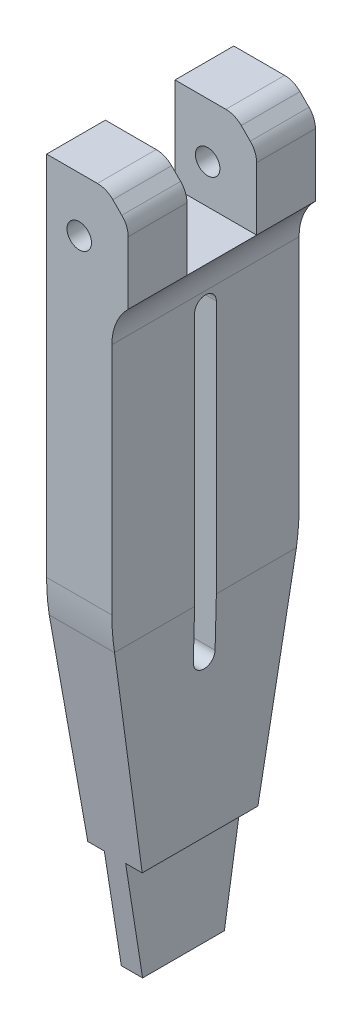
ISO-10303-21;
HEADER;
FILE_DESCRIPTION(('STEP AP214'),'2;1');
FILE_NAME('part.step','',(''),(''),'','','');
FILE_SCHEMA(('AUTOMOTIVE_DESIGN { 1 0 10303 214 1 1 1 1 }'));
ENDSEC;
DATA;
#1=APPLICATION_CONTEXT('core data for automotive mechanical design processes');
#2=APPLICATION_PROTOCOL_DEFINITION('international standard','automotive_design',2000,#1);
#3=PRODUCT_CONTEXT('',#1,'mechanical');
#4=PRODUCT('Part','Part','',(#3));
#5=PRODUCT_RELATED_PRODUCT_CATEGORY('part','',(#4));
#6=PRODUCT_DEFINITION_FORMATION('','',#4);
#7=PRODUCT_DEFINITION_CONTEXT('part definition',#1,'design');
#8=PRODUCT_DEFINITION('design','',#6,#7);
#9=PRODUCT_DEFINITION_SHAPE('','',#8);
#10=(LENGTH_UNIT() NAMED_UNIT(*) SI_UNIT(.MILLI.,.METRE.));
#11=(NAMED_UNIT(*) PLANE_ANGLE_UNIT() SI_UNIT($,.RADIAN.));
#12=(NAMED_UNIT(*) SI_UNIT($,.STERADIAN.) SOLID_ANGLE_UNIT());
#13=UNCERTAINTY_MEASURE_WITH_UNIT(LENGTH_MEASURE(1.E-05),#10,'distance_accuracy_value','');
#14=(GEOMETRIC_REPRESENTATION_CONTEXT(3) GLOBAL_UNCERTAINTY_ASSIGNED_CONTEXT((#13)) GLOBAL_UNIT_ASSIGNED_CONTEXT((#10,
#11,#12)) REPRESENTATION_CONTEXT('',''));
#15=CARTESIAN_POINT('',(0.,0.,0.));
#16=DIRECTION('',(0.,0.,1.));
#17=DIRECTION('',(1.,0.,0.));
#18=AXIS2_PLACEMENT_3D('',#15,#16,#17);
#19=CARTESIAN_POINT('',(4.5,35.25,28.6109596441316));
#20=DIRECTION('',(0.,1.,0.));
#21=DIRECTION('',(0.,0.,1.));
#22=AXIS2_PLACEMENT_3D('',#19,#20,#21);
#23=PLANE('',#22);
#24=DIRECTION('',(1.,0.,0.));
#25=VECTOR('',#24,1.);
#26=CARTESIAN_POINT('',(4.5,35.25,17.2));
#27=LINE('',#26,#25);
#28=CARTESIAN_POINT('',(-3.,35.25,17.2));
#29=VERTEX_POINT('',#28);
#30=CARTESIAN_POINT('',(1.67157287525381,35.25,17.2));
#31=VERTEX_POINT('',#30);
#32=EDGE_CURVE('E447',#29,#31,#27,.T.);
#33=ORIENTED_EDGE('',*,*,#32,.T.);
#34=DIRECTION('',(0.,0.,1.));
#35=VECTOR('',#34,1.);
#36=CARTESIAN_POINT('',(1.67157287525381,35.25,28.6109596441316));
#37=LINE('',#36,#35);
#38=CARTESIAN_POINT('',(1.67157287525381,35.25,11.8));
#39=VERTEX_POINT('',#38);
#40=EDGE_CURVE('E11',#31,#39,#37,.F.);
#41=ORIENTED_EDGE('',*,*,#40,.T.);
#42=DIRECTION('',(1.,0.,0.));
#43=VECTOR('',#42,1.);
#44=CARTESIAN_POINT('',(-5.5,35.25,11.8));
#45=LINE('',#44,#43);
#46=CARTESIAN_POINT('',(-3.,35.25,11.8));
#47=VERTEX_POINT('',#46);
#48=EDGE_CURVE('E433',#47,#39,#45,.T.);
#49=ORIENTED_EDGE('',*,*,#48,.F.);
#50=DIRECTION('',(0.,0.,-1.));
#51=VECTOR('',#50,1.);
#52=CARTESIAN_POINT('',(-3.,35.25,28.6109596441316));
#53=LINE('',#52,#51);
#54=EDGE_CURVE('E450',#29,#47,#53,.T.);
#55=ORIENTED_EDGE('',*,*,#54,.F.);
#56=EDGE_LOOP('',(#33,#41,#49,#55));
#57=FACE_BOUND('',#56,.T.);
#58=ADVANCED_FACE('F36',(#57),#23,.T.);
#59=CARTESIAN_POINT('',(4.5,26.65,28.6109596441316));
#60=DIRECTION('',(1.,0.,0.));
#61=DIRECTION('',(0.,0.,-1.));
#62=AXIS2_PLACEMENT_3D('',#59,#60,#61);
#63=PLANE('',#62);
#64=DIRECTION('',(0.,-1.,0.));
#65=VECTOR('',#64,1.);
#66=CARTESIAN_POINT('',(4.5,35.25,11.8));
#67=LINE('',#66,#65);
#68=CARTESIAN_POINT('',(4.5,32.4215728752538,11.8));
#69=VERTEX_POINT('',#68);
#70=CARTESIAN_POINT('',(4.5,26.65,11.8));
#71=VERTEX_POINT('',#70);
#72=EDGE_CURVE('E426',#69,#71,#67,.T.);
#73=ORIENTED_EDGE('',*,*,#72,.F.);
#74=DIRECTION('',(0.,0.,-1.));
#75=VECTOR('',#74,1.);
#76=CARTESIAN_POINT('',(4.5,32.4215728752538,28.6109596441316));
#77=LINE('',#76,#75);
#78=CARTESIAN_POINT('',(4.5,32.4215728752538,17.2));
#79=VERTEX_POINT('',#78);
#80=EDGE_CURVE('E808',#69,#79,#77,.F.);
#81=ORIENTED_EDGE('',*,*,#80,.T.);
#82=DIRECTION('',(0.,-1.,0.));
#83=VECTOR('',#82,1.);
#84=CARTESIAN_POINT('',(4.5,26.65,17.2));
#85=LINE('',#84,#83);
#86=CARTESIAN_POINT('',(4.5,26.65,17.2));
#87=VERTEX_POINT('',#86);
#88=EDGE_CURVE('E444',#79,#87,#85,.T.);
#89=ORIENTED_EDGE('',*,*,#88,.T.);
#90=DIRECTION('',(0.,0.,-1.));
#91=VECTOR('',#90,1.);
#92=CARTESIAN_POINT('',(4.5,26.65,28.6109596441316));
#93=LINE('',#92,#91);
#94=EDGE_CURVE('E451',#87,#71,#93,.T.);
#95=ORIENTED_EDGE('',*,*,#94,.T.);
#96=EDGE_LOOP('',(#73,#81,#89,#95));
#97=FACE_BOUND('',#96,.T.);
#98=ADVANCED_FACE('F827',(#97),#63,.T.);
#99=CARTESIAN_POINT('',(-3.00000000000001,0.31117857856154,15.2243563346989));
#100=DIRECTION('',(0.,0.155589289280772,-0.987821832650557));
#101=DIRECTION('',(0.,0.987821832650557,0.155589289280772));
#102=AXIS2_PLACEMENT_3D('',#99,#100,#101);
#103=PLANE('',#102);
#104=DIRECTION('',(0.,0.987821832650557,0.155589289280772));
#105=VECTOR('',#104,1.);
#106=CARTESIAN_POINT('',(1.,0.31117857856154,15.2243563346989));
#107=LINE('',#106,#105);
#108=CARTESIAN_POINT('',(1.,-13.9326725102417,12.9808437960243));
#109=VERTEX_POINT('',#108);
#110=CARTESIAN_POINT('',(1.,-1.23518231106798,14.98079298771));
#111=VERTEX_POINT('',#110);
#112=EDGE_CURVE('E534',#109,#111,#107,.T.);
#113=ORIENTED_EDGE('',*,*,#112,.F.);
#114=DIRECTION('',(1.,0.,0.));
#115=VECTOR('',#114,1.);
#116=CARTESIAN_POINT('',(-13.7530215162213,-13.9326725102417,12.9808437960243));
#117=LINE('',#116,#115);
#118=CARTESIAN_POINT('',(-2.67912879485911,-13.9326725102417,12.9808437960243));
#119=VERTEX_POINT('',#118);
#120=EDGE_CURVE('E461',#119,#109,#117,.T.);
#121=ORIENTED_EDGE('',*,*,#120,.F.);
#122=DIRECTION('',(-0.0255814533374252,0.987498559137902,0.155538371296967));
#123=VECTOR('',#122,1.);
#124=CARTESIAN_POINT('',(-3.04808863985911,0.309962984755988,15.224164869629));
#125=LINE('',#124,#123);
#126=CARTESIAN_POINT('',(-3.00000000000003,-1.54636088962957,14.9317800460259));
#127=VERTEX_POINT('',#126);
#128=EDGE_CURVE('E491',#119,#127,#125,.T.);
#129=ORIENTED_EDGE('',*,*,#128,.T.);
#130=DIRECTION('',(0.,0.987821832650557,0.155589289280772));
#131=VECTOR('',#130,1.);
#132=CARTESIAN_POINT('',(-3.,33.2441576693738,20.4115456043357));
#133=LINE('',#132,#131);
#134=CARTESIAN_POINT('',(-3.,-1.23518231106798,14.98079298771));
#135=VERTEX_POINT('',#134);
#136=EDGE_CURVE('E566',#127,#135,#133,.T.);
#137=ORIENTED_EDGE('',*,*,#136,.T.);
#138=DIRECTION('',(1.,0.,0.));
#139=VECTOR('',#138,1.);
#140=CARTESIAN_POINT('',(-3.00000000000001,-1.23518231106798,14.98079298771));
#141=LINE('',#140,#139);
#142=EDGE_CURVE('E563',#111,#135,#141,.F.);
#143=ORIENTED_EDGE('',*,*,#142,.F.);
#144=EDGE_LOOP('',(#113,#121,#129,#137,#143));
#145=FACE_BOUND('',#144,.T.);
#146=ADVANCED_FACE('F953',(#145),#103,.T.);
#147=CARTESIAN_POINT('',(-3.00000000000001,0.311178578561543,1.97564366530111));
#148=DIRECTION('',(0.,0.155589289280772,0.987821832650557));
#149=DIRECTION('',(0.,-0.987821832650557,0.155589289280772));
#150=AXIS2_PLACEMENT_3D('',#147,#148,#149);
#151=PLANE('',#150);
#152=DIRECTION('',(0.0255814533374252,-0.987498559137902,0.155538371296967));
#153=VECTOR('',#152,1.);
#154=CARTESIAN_POINT('',(-3.04808863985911,0.309962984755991,1.97583513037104));
#155=LINE('',#154,#153);
#156=CARTESIAN_POINT('',(-2.99999999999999,-1.54636088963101,2.26821995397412));
#157=VERTEX_POINT('',#156);
#158=CARTESIAN_POINT('',(-2.67912879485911,-13.9326725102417,4.21915620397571));
#159=VERTEX_POINT('',#158);
#160=EDGE_CURVE('E489',#157,#159,#155,.T.);
#161=ORIENTED_EDGE('',*,*,#160,.T.);
#162=DIRECTION('',(1.,0.,0.));
#163=VECTOR('',#162,1.);
#164=CARTESIAN_POINT('',(-13.7530215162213,-13.9326725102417,4.21915620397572));
#165=LINE('',#164,#163);
#166=CARTESIAN_POINT('',(1.,-13.9326725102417,4.21915620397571));
#167=VERTEX_POINT('',#166);
#168=EDGE_CURVE('E454',#159,#167,#165,.T.);
#169=ORIENTED_EDGE('',*,*,#168,.T.);
#170=DIRECTION('',(0.,-0.987821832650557,0.155589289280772));
#171=VECTOR('',#170,1.);
#172=CARTESIAN_POINT('',(1.,0.311178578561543,1.97564366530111));
#173=LINE('',#172,#171);
#174=CARTESIAN_POINT('',(1.,-1.23518231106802,2.21920701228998));
#175=VERTEX_POINT('',#174);
#176=EDGE_CURVE('E567',#175,#167,#173,.T.);
#177=ORIENTED_EDGE('',*,*,#176,.F.);
#178=DIRECTION('',(1.,0.,0.));
#179=VECTOR('',#178,1.);
#180=CARTESIAN_POINT('',(-3.00000000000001,-1.23518231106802,2.21920701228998));
#181=LINE('',#180,#179);
#182=CARTESIAN_POINT('',(-3.,-1.23518231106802,2.21920701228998));
#183=VERTEX_POINT('',#182);
#184=EDGE_CURVE('E575',#183,#175,#181,.T.);
#185=ORIENTED_EDGE('',*,*,#184,.F.);
#186=DIRECTION('',(0.,-0.987821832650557,0.155589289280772));
#187=VECTOR('',#186,1.);
#188=CARTESIAN_POINT('',(-3.,30.60061232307,-2.79516754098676));
#189=LINE('',#188,#187);
#190=EDGE_CURVE('E570',#183,#157,#189,.T.);
#191=ORIENTED_EDGE('',*,*,#190,.T.);
#192=EDGE_LOOP('',(#161,#169,#177,#185,#191));
#193=FACE_BOUND('',#192,.T.);
#194=ADVANCED_FACE('F1045',(#193),#151,.T.);
#195=CARTESIAN_POINT('',(1.,28.75,17.2));
#196=DIRECTION('',(-1.,0.,0.));
#197=DIRECTION('',(0.,0.,1.));
#198=AXIS2_PLACEMENT_3D('',#195,#196,#197);
#199=PLANE('',#198);
#200=ORIENTED_EDGE('',*,*,#176,.T.);
#201=DIRECTION('',(0.,0.,-1.));
#202=VECTOR('',#201,1.);
#203=CARTESIAN_POINT('',(1.,-13.9326725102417,12.9808437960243));
#204=LINE('',#203,#202);
#205=EDGE_CURVE('E457',#109,#167,#204,.T.);
#206=ORIENTED_EDGE('',*,*,#205,.F.);
#207=ORIENTED_EDGE('',*,*,#112,.T.);
#208=CARTESIAN_POINT('',(1.,1.56542489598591,-2.8));
#209=DIRECTION('',(-1.,0.,0.));
#210=DIRECTION('',(0.,0.,1.));
#211=AXIS2_PLACEMENT_3D('',#208,#209,#210);
#212=CIRCLE('',#211,18.);
#213=CARTESIAN_POINT('',(1.,1.56542489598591,15.2));
#214=VERTEX_POINT('',#213);
#215=EDGE_CURVE('E560',#214,#111,#212,.F.);
#216=ORIENTED_EDGE('',*,*,#215,.F.);
#217=DIRECTION('',(0.,1.,0.));
#218=VECTOR('',#217,1.);
#219=CARTESIAN_POINT('',(1.,28.75,15.2));
#220=LINE('',#219,#218);
#221=CARTESIAN_POINT('',(1.,27.2893201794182,15.2));
#222=VERTEX_POINT('',#221);
#223=EDGE_CURVE('E543',#214,#222,#220,.T.);
#224=ORIENTED_EDGE('',*,*,#223,.T.);
#225=DIRECTION('',(0.,0.,-1.));
#226=VECTOR('',#225,1.);
#227=CARTESIAN_POINT('',(1.,27.2893201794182,17.2));
#228=LINE('',#227,#226);
#229=CARTESIAN_POINT('',(1.,27.2893201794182,13.8));
#230=VERTEX_POINT('',#229);
#231=EDGE_CURVE('E684',#222,#230,#228,.T.);
#232=ORIENTED_EDGE('',*,*,#231,.T.);
#233=DIRECTION('',(0.,-1.,0.));
#234=VECTOR('',#233,1.);
#235=CARTESIAN_POINT('',(1.,26.65,13.8));
#236=LINE('',#235,#234);
#237=CARTESIAN_POINT('',(1.,24.65,13.8));
#238=VERTEX_POINT('',#237);
#239=EDGE_CURVE('E589',#230,#238,#236,.T.);
#240=ORIENTED_EDGE('',*,*,#239,.T.);
#241=DIRECTION('',(0.,0.,-1.));
#242=VECTOR('',#241,1.);
#243=CARTESIAN_POINT('',(1.,24.65,5.4));
#244=LINE('',#243,#242);
#245=CARTESIAN_POINT('',(1.,24.65,9.36811457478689));
#246=VERTEX_POINT('',#245);
#247=EDGE_CURVE('E588',#238,#246,#244,.T.);
#248=ORIENTED_EDGE('',*,*,#247,.T.);
#249=CARTESIAN_POINT('',(1.,21.75,8.6));
#250=DIRECTION('',(-1.,0.,0.));
#251=DIRECTION('',(0.,0.,1.));
#252=AXIS2_PLACEMENT_3D('',#249,#250,#251);
#253=CIRCLE('',#252,3.);
#254=CARTESIAN_POINT('',(1.,21.75,11.6));
#255=VERTEX_POINT('',#254);
#256=EDGE_CURVE('E548',#246,#255,#253,.F.);
#257=ORIENTED_EDGE('',*,*,#256,.T.);
#258=DIRECTION('',(0.,-1.,0.));
#259=VECTOR('',#258,1.);
#260=CARTESIAN_POINT('',(1.,21.75,11.6));
#261=LINE('',#260,#259);
#262=CARTESIAN_POINT('',(1.,-6.09344084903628,11.6));
#263=VERTEX_POINT('',#262);
#264=EDGE_CURVE('E544',#255,#263,#261,.T.);
#265=ORIENTED_EDGE('',*,*,#264,.T.);
#266=CARTESIAN_POINT('',(1.,-6.09344084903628,8.6));
#267=DIRECTION('',(-1.,0.,0.));
#268=DIRECTION('',(0.,0.,1.));
#269=AXIS2_PLACEMENT_3D('',#266,#267,#268);
#270=CIRCLE('',#269,3.);
#271=CARTESIAN_POINT('',(1.,-6.09344084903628,5.59999999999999));
#272=VERTEX_POINT('',#271);
#273=EDGE_CURVE('E547',#263,#272,#270,.F.);
#274=ORIENTED_EDGE('',*,*,#273,.T.);
#275=DIRECTION('',(0.,1.,0.));
#276=VECTOR('',#275,1.);
#277=CARTESIAN_POINT('',(1.,-6.09344084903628,5.59999999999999));
#278=LINE('',#277,#276);
#279=CARTESIAN_POINT('',(1.,21.75,5.59999999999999));
#280=VERTEX_POINT('',#279);
#281=EDGE_CURVE('E551',#272,#280,#278,.T.);
#282=ORIENTED_EDGE('',*,*,#281,.T.);
#283=CARTESIAN_POINT('',(1.,24.65,7.8318854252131));
#284=VERTEX_POINT('',#283);
#285=EDGE_CURVE('E550',#280,#284,#253,.F.);
#286=ORIENTED_EDGE('',*,*,#285,.T.);
#287=CARTESIAN_POINT('',(1.,24.65,3.4));
#288=VERTEX_POINT('',#287);
#289=EDGE_CURVE('E585',#284,#288,#244,.T.);
#290=ORIENTED_EDGE('',*,*,#289,.T.);
#291=DIRECTION('',(0.,1.,0.));
#292=VECTOR('',#291,1.);
#293=CARTESIAN_POINT('',(1.,33.75,3.4));
#294=LINE('',#293,#292);
#295=CARTESIAN_POINT('',(1.,27.2893201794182,3.4));
#296=VERTEX_POINT('',#295);
#297=EDGE_CURVE('E581',#288,#296,#294,.T.);
#298=ORIENTED_EDGE('',*,*,#297,.T.);
#299=DIRECTION('',(0.,0.,-1.));
#300=VECTOR('',#299,1.);
#301=CARTESIAN_POINT('',(1.,27.2893201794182,17.2));
#302=LINE('',#301,#300);
#303=CARTESIAN_POINT('',(1.,27.2893201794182,2.));
#304=VERTEX_POINT('',#303);
#305=EDGE_CURVE('E686',#296,#304,#302,.T.);
#306=ORIENTED_EDGE('',*,*,#305,.T.);
#307=DIRECTION('',(0.,1.,0.));
#308=VECTOR('',#307,1.);
#309=CARTESIAN_POINT('',(1.,28.75,2.));
#310=LINE('',#309,#308);
#311=CARTESIAN_POINT('',(1.,1.56542489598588,2.));
#312=VERTEX_POINT('',#311);
#313=EDGE_CURVE('E576',#312,#304,#310,.T.);
#314=ORIENTED_EDGE('',*,*,#313,.F.);
#315=CARTESIAN_POINT('',(0.999999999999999,1.56542489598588,20.));
#316=DIRECTION('',(-1.,0.,0.));
#317=DIRECTION('',(0.,0.,1.));
#318=AXIS2_PLACEMENT_3D('',#315,#316,#317);
#319=CIRCLE('',#318,18.);
#320=EDGE_CURVE('E571',#175,#312,#319,.F.);
#321=ORIENTED_EDGE('',*,*,#320,.F.);
#322=EDGE_LOOP('',(#200,#206,#207,#216,#224,#232,#240,#248,#257,#265,#274,#282,#286,#290,#298,
#306,#314,#321));
#323=FACE_BOUND('',#322,.T.);
#324=ADVANCED_FACE('F927',(#323),#199,.T.);
#325=CARTESIAN_POINT('',(-3.,33.75,17.2));
#326=DIRECTION('',(1.,0.,0.));
#327=DIRECTION('',(0.,1.,0.));
#328=AXIS2_PLACEMENT_3D('',#325,#326,#327);
#329=PLANE('',#328);
#330=ORIENTED_EDGE('',*,*,#54,.T.);
#331=DIRECTION('',(0.,-1.,0.));
#332=VECTOR('',#331,1.);
#333=CARTESIAN_POINT('',(-3.,26.65,11.8));
#334=LINE('',#333,#332);
#335=CARTESIAN_POINT('',(-3.,26.65,11.8));
#336=VERTEX_POINT('',#335);
#337=EDGE_CURVE('E688',#47,#336,#334,.T.);
#338=ORIENTED_EDGE('',*,*,#337,.T.);
#339=DIRECTION('',(0.,0.,-1.));
#340=VECTOR('',#339,1.);
#341=CARTESIAN_POINT('',(-3.,26.65,5.4));
#342=LINE('',#341,#340);
#343=CARTESIAN_POINT('',(-3.,26.65,5.4));
#344=VERTEX_POINT('',#343);
#345=EDGE_CURVE('E690',#336,#344,#342,.T.);
#346=ORIENTED_EDGE('',*,*,#345,.T.);
#347=DIRECTION('',(0.,1.,0.));
#348=VECTOR('',#347,1.);
#349=CARTESIAN_POINT('',(-3.,33.75,5.4));
#350=LINE('',#349,#348);
#351=CARTESIAN_POINT('',(-3.,35.25,5.4));
#352=VERTEX_POINT('',#351);
#353=EDGE_CURVE('E693',#344,#352,#350,.T.);
#354=ORIENTED_EDGE('',*,*,#353,.T.);
#355=CARTESIAN_POINT('',(-3.,35.25,0.));
#356=VERTEX_POINT('',#355);
#357=EDGE_CURVE('E441',#352,#356,#53,.T.);
#358=ORIENTED_EDGE('',*,*,#357,.T.);
#359=DIRECTION('',(0.,-1.,0.));
#360=VECTOR('',#359,1.);
#361=CARTESIAN_POINT('',(-3.,33.75,0.));
#362=LINE('',#361,#360);
#363=CARTESIAN_POINT('',(-2.99999999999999,1.56542489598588,0.));
#364=VERTEX_POINT('',#363);
#365=EDGE_CURVE('E736',#356,#364,#362,.T.);
#366=ORIENTED_EDGE('',*,*,#365,.T.);
#367=CARTESIAN_POINT('',(-2.99999999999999,1.56542489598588,20.));
#368=DIRECTION('',(1.,0.,0.));
#369=DIRECTION('',(0.,1.,0.));
#370=AXIS2_PLACEMENT_3D('',#367,#368,#369);
#371=CIRCLE('',#370,20.);
#372=CARTESIAN_POINT('',(-3.00000000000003,-1.54636088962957,0.24356334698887));
#373=VERTEX_POINT('',#372);
#374=EDGE_CURVE('E754',#364,#373,#371,.F.);
#375=ORIENTED_EDGE('',*,*,#374,.T.);
#376=DIRECTION('',(0.,0.,-1.));
#377=VECTOR('',#376,1.);
#378=CARTESIAN_POINT('',(-3.00000000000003,-1.54636088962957,17.2));
#379=LINE('',#378,#377);
#380=EDGE_CURVE('E464',#157,#373,#379,.T.);
#381=ORIENTED_EDGE('',*,*,#380,.F.);
#382=ORIENTED_EDGE('',*,*,#190,.F.);
#383=CARTESIAN_POINT('',(-2.99999999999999,1.56542489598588,20.));
#384=DIRECTION('',(1.,0.,0.));
#385=DIRECTION('',(0.,1.,0.));
#386=AXIS2_PLACEMENT_3D('',#383,#384,#385);
#387=CIRCLE('',#386,18.);
#388=CARTESIAN_POINT('',(-2.99999999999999,1.56542489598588,2.));
#389=VERTEX_POINT('',#388);
#390=EDGE_CURVE('E595',#389,#183,#387,.F.);
#391=ORIENTED_EDGE('',*,*,#390,.F.);
#392=DIRECTION('',(0.,-1.,0.));
#393=VECTOR('',#392,1.);
#394=CARTESIAN_POINT('',(-3.,33.75,2.));
#395=LINE('',#394,#393);
#396=CARTESIAN_POINT('',(-3.,29.375,2.));
#397=VERTEX_POINT('',#396);
#398=EDGE_CURVE('E649',#397,#389,#395,.T.);
#399=ORIENTED_EDGE('',*,*,#398,.F.);
#400=DIRECTION('',(0.,0.,-1.));
#401=VECTOR('',#400,1.);
#402=CARTESIAN_POINT('',(-3.,29.375,17.2));
#403=LINE('',#402,#401);
#404=CARTESIAN_POINT('',(-3.,29.375,3.4));
#405=VERTEX_POINT('',#404);
#406=EDGE_CURVE('E682',#405,#397,#403,.T.);
#407=ORIENTED_EDGE('',*,*,#406,.F.);
#408=DIRECTION('',(0.,1.,0.));
#409=VECTOR('',#408,1.);
#410=CARTESIAN_POINT('',(-3.,33.75,3.4));
#411=LINE('',#410,#409);
#412=CARTESIAN_POINT('',(-3.,24.65,3.4));
#413=VERTEX_POINT('',#412);
#414=EDGE_CURVE('E644',#413,#405,#411,.T.);
#415=ORIENTED_EDGE('',*,*,#414,.F.);
#416=DIRECTION('',(0.,0.,-1.));
#417=VECTOR('',#416,1.);
#418=CARTESIAN_POINT('',(-3.,24.65,17.2));
#419=LINE('',#418,#417);
#420=CARTESIAN_POINT('',(-3.,24.65,7.8318854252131));
#421=VERTEX_POINT('',#420);
#422=EDGE_CURVE('E640',#421,#413,#419,.T.);
#423=ORIENTED_EDGE('',*,*,#422,.F.);
#424=CARTESIAN_POINT('',(-3.,21.75,8.6));
#425=DIRECTION('',(1.,0.,0.));
#426=DIRECTION('',(0.,1.,0.));
#427=AXIS2_PLACEMENT_3D('',#424,#425,#426);
#428=CIRCLE('',#427,3.);
#429=CARTESIAN_POINT('',(-3.,21.75,5.59999999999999));
#430=VERTEX_POINT('',#429);
#431=EDGE_CURVE('E661',#430,#421,#428,.T.);
#432=ORIENTED_EDGE('',*,*,#431,.F.);
#433=DIRECTION('',(0.,1.,0.));
#434=VECTOR('',#433,1.);
#435=CARTESIAN_POINT('',(-3.,33.75,5.6));
#436=LINE('',#435,#434);
#437=CARTESIAN_POINT('',(-2.99999999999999,-1.54636088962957,5.59999999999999));
#438=VERTEX_POINT('',#437);
#439=EDGE_CURVE('E630',#438,#430,#436,.T.);
#440=ORIENTED_EDGE('',*,*,#439,.F.);
#441=CARTESIAN_POINT('',(-3.00000000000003,-1.54636088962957,7.59999999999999));
#442=VERTEX_POINT('',#441);
#443=EDGE_CURVE('E469',#442,#438,#379,.T.);
#444=ORIENTED_EDGE('',*,*,#443,.F.);
#445=DIRECTION('',(0.,1.,0.));
#446=VECTOR('',#445,1.);
#447=CARTESIAN_POINT('',(-3.,-6.09344084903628,7.59999999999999));
#448=LINE('',#447,#446);
#449=CARTESIAN_POINT('',(-3.,21.75,7.59999999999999));
#450=VERTEX_POINT('',#449);
#451=EDGE_CURVE('E715',#442,#450,#448,.T.);
#452=ORIENTED_EDGE('',*,*,#451,.T.);
#453=CARTESIAN_POINT('',(-3.,21.75,8.6));
#454=DIRECTION('',(1.,0.,0.));
#455=DIRECTION('',(0.,0.,-1.));
#456=AXIS2_PLACEMENT_3D('',#453,#454,#455);
#457=CIRCLE('',#456,1.);
#458=CARTESIAN_POINT('',(-3.,21.75,9.6));
#459=VERTEX_POINT('',#458);
#460=EDGE_CURVE('E708',#450,#459,#457,.T.);
#461=ORIENTED_EDGE('',*,*,#460,.T.);
#462=DIRECTION('',(0.,-1.,0.));
#463=VECTOR('',#462,1.);
#464=CARTESIAN_POINT('',(-3.,21.75,9.6));
#465=LINE('',#464,#463);
#466=CARTESIAN_POINT('',(-3.00000000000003,-1.54636088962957,9.6));
#467=VERTEX_POINT('',#466);
#468=EDGE_CURVE('E711',#459,#467,#465,.T.);
#469=ORIENTED_EDGE('',*,*,#468,.T.);
#470=CARTESIAN_POINT('',(-3.00000000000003,-1.54636088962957,11.6));
#471=VERTEX_POINT('',#470);
#472=EDGE_CURVE('E900',#471,#467,#379,.T.);
#473=ORIENTED_EDGE('',*,*,#472,.F.);
#474=DIRECTION('',(0.,-1.,0.));
#475=VECTOR('',#474,1.);
#476=CARTESIAN_POINT('',(-3.,33.75,11.6));
#477=LINE('',#476,#475);
#478=CARTESIAN_POINT('',(-3.,21.75,11.6));
#479=VERTEX_POINT('',#478);
#480=EDGE_CURVE('E663',#479,#471,#477,.T.);
#481=ORIENTED_EDGE('',*,*,#480,.F.);
#482=CARTESIAN_POINT('',(-3.,24.65,9.36811457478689));
#483=VERTEX_POINT('',#482);
#484=EDGE_CURVE('E554',#483,#479,#428,.T.);
#485=ORIENTED_EDGE('',*,*,#484,.F.);
#486=CARTESIAN_POINT('',(-3.,24.65,13.8));
#487=VERTEX_POINT('',#486);
#488=EDGE_CURVE('E641',#487,#483,#419,.T.);
#489=ORIENTED_EDGE('',*,*,#488,.F.);
#490=DIRECTION('',(0.,-1.,0.));
#491=VECTOR('',#490,1.);
#492=CARTESIAN_POINT('',(-3.,33.75,13.8));
#493=LINE('',#492,#491);
#494=CARTESIAN_POINT('',(-3.,29.375,13.8));
#495=VERTEX_POINT('',#494);
#496=EDGE_CURVE('E637',#495,#487,#493,.T.);
#497=ORIENTED_EDGE('',*,*,#496,.F.);
#498=DIRECTION('',(0.,0.,-1.));
#499=VECTOR('',#498,1.);
#500=CARTESIAN_POINT('',(-3.,29.375,17.2));
#501=LINE('',#500,#499);
#502=CARTESIAN_POINT('',(-3.,29.375,15.2));
#503=VERTEX_POINT('',#502);
#504=EDGE_CURVE('E670',#503,#495,#501,.T.);
#505=ORIENTED_EDGE('',*,*,#504,.F.);
#506=DIRECTION('',(0.,-1.,0.));
#507=VECTOR('',#506,1.);
#508=CARTESIAN_POINT('',(-3.,33.75,15.2));
#509=LINE('',#508,#507);
#510=CARTESIAN_POINT('',(-3.,1.56542489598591,15.2));
#511=VERTEX_POINT('',#510);
#512=EDGE_CURVE('E652',#503,#511,#509,.T.);
#513=ORIENTED_EDGE('',*,*,#512,.T.);
#514=CARTESIAN_POINT('',(-2.99999999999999,1.56542489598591,-2.8));
#515=DIRECTION('',(1.,0.,0.));
#516=DIRECTION('',(0.,1.,0.));
#517=AXIS2_PLACEMENT_3D('',#514,#515,#516);
#518=CIRCLE('',#517,18.);
#519=EDGE_CURVE('E625',#135,#511,#518,.F.);
#520=ORIENTED_EDGE('',*,*,#519,.F.);
#521=ORIENTED_EDGE('',*,*,#136,.F.);
#522=CARTESIAN_POINT('',(-3.00000000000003,-1.54636088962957,16.9564366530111));
#523=VERTEX_POINT('',#522);
#524=EDGE_CURVE('E470',#523,#127,#379,.T.);
#525=ORIENTED_EDGE('',*,*,#524,.F.);
#526=CARTESIAN_POINT('',(-2.99999999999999,1.56542489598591,-2.8));
#527=DIRECTION('',(1.,0.,0.));
#528=DIRECTION('',(0.,1.,0.));
#529=AXIS2_PLACEMENT_3D('',#526,#527,#528);
#530=CIRCLE('',#529,20.);
#531=CARTESIAN_POINT('',(-3.,1.56542489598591,17.2));
#532=VERTEX_POINT('',#531);
#533=EDGE_CURVE('E766',#523,#532,#530,.F.);
#534=ORIENTED_EDGE('',*,*,#533,.T.);
#535=DIRECTION('',(0.,-1.,0.));
#536=VECTOR('',#535,1.);
#537=CARTESIAN_POINT('',(-3.,28.75,17.2));
#538=LINE('',#537,#536);
#539=EDGE_CURVE('E733',#29,#532,#538,.T.);
#540=ORIENTED_EDGE('',*,*,#539,.F.);
#541=EDGE_LOOP('',(#330,#338,#346,#354,#358,#366,#375,#381,#382,#391,#399,#407,#415,#423,#432,
#440,#444,#452,#461,#469,#473,#481,#485,#489,#497,#505,#513,#520,#521,#525,#534,#540));
#542=FACE_BOUND('',#541,.T.);
#543=CARTESIAN_POINT('',(-3.,31.125,3.4));
#544=VERTEX_POINT('',#543);
#545=CARTESIAN_POINT('',(-3.,31.75,3.4));
#546=VERTEX_POINT('',#545);
#547=EDGE_CURVE('E613',#544,#546,#411,.T.);
#548=ORIENTED_EDGE('',*,*,#547,.F.);
#549=DIRECTION('',(0.,0.,-1.));
#550=VECTOR('',#549,1.);
#551=CARTESIAN_POINT('',(-3.,31.125,17.2));
#552=LINE('',#551,#550);
#553=CARTESIAN_POINT('',(-3.,31.125,2.));
#554=VERTEX_POINT('',#553);
#555=EDGE_CURVE('E679',#544,#554,#552,.T.);
#556=ORIENTED_EDGE('',*,*,#555,.T.);
#557=CARTESIAN_POINT('',(-3.,31.75,2.));
#558=VERTEX_POINT('',#557);
#559=EDGE_CURVE('E602',#558,#554,#395,.T.);
#560=ORIENTED_EDGE('',*,*,#559,.F.);
#561=DIRECTION('',(0.,0.,-1.));
#562=VECTOR('',#561,1.);
#563=CARTESIAN_POINT('',(-3.,31.75,17.2));
#564=LINE('',#563,#562);
#565=EDGE_CURVE('E542',#546,#558,#564,.T.);
#566=ORIENTED_EDGE('',*,*,#565,.F.);
#567=EDGE_LOOP('',(#548,#556,#560,#566));
#568=FACE_BOUND('',#567,.T.);
#569=CARTESIAN_POINT('',(-3.,31.75,15.2));
#570=VERTEX_POINT('',#569);
#571=CARTESIAN_POINT('',(-3.,31.125,15.2));
#572=VERTEX_POINT('',#571);
#573=EDGE_CURVE('E559',#570,#572,#509,.T.);
#574=ORIENTED_EDGE('',*,*,#573,.T.);
#575=DIRECTION('',(0.,0.,-1.));
#576=VECTOR('',#575,1.);
#577=CARTESIAN_POINT('',(-3.,31.125,17.2));
#578=LINE('',#577,#576);
#579=CARTESIAN_POINT('',(-3.,31.125,13.8));
#580=VERTEX_POINT('',#579);
#581=EDGE_CURVE('E672',#572,#580,#578,.T.);
#582=ORIENTED_EDGE('',*,*,#581,.T.);
#583=CARTESIAN_POINT('',(-3.,31.75,13.8));
#584=VERTEX_POINT('',#583);
#585=EDGE_CURVE('E584',#584,#580,#493,.T.);
#586=ORIENTED_EDGE('',*,*,#585,.F.);
#587=DIRECTION('',(0.,0.,-1.));
#588=VECTOR('',#587,1.);
#589=CARTESIAN_POINT('',(-3.,31.75,17.2));
#590=LINE('',#589,#588);
#591=EDGE_CURVE('E593',#570,#584,#590,.T.);
#592=ORIENTED_EDGE('',*,*,#591,.F.);
#593=EDGE_LOOP('',(#574,#582,#586,#592));
#594=FACE_BOUND('',#593,.T.);
#595=ADVANCED_FACE('F842',(#542,#568,#594),#329,.F.);
#596=CARTESIAN_POINT('',(-3.,-6.09344084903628,7.59999999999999));
#597=DIRECTION('',(0.,0.,-1.));
#598=DIRECTION('',(0.,1.,0.));
#599=AXIS2_PLACEMENT_3D('',#596,#597,#598);
#600=PLANE('',#599);
#601=DIRECTION('',(-0.0258966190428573,0.999664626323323,0.));
#602=VECTOR('',#601,1.);
#603=CARTESIAN_POINT('',(-2.88228549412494,-6.09039141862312,7.59999999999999));
#604=LINE('',#603,#602);
#605=CARTESIAN_POINT('',(-2.88220649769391,-6.09344084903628,7.59999999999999));
#606=VERTEX_POINT('',#605);
#607=EDGE_CURVE('E487',#606,#442,#604,.T.);
#608=ORIENTED_EDGE('',*,*,#607,.F.);
#609=DIRECTION('',(1.,0.,0.));
#610=VECTOR('',#609,1.);
#611=CARTESIAN_POINT('',(-3.,-6.09344084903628,7.59999999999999));
#612=LINE('',#611,#610);
#613=CARTESIAN_POINT('',(2.88220649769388,-6.09344084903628,7.59999999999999));
#614=VERTEX_POINT('',#613);
#615=EDGE_CURVE('E727',#606,#614,#612,.T.);
#616=ORIENTED_EDGE('',*,*,#615,.T.);
#617=DIRECTION('',(0.025896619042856,0.999664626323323,0.));
#618=VECTOR('',#617,1.);
#619=CARTESIAN_POINT('',(2.87826168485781,-6.24571902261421,7.59999999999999));
#620=LINE('',#619,#618);
#621=CARTESIAN_POINT('',(3.,-1.54636088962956,7.59999999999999));
#622=VERTEX_POINT('',#621);
#623=EDGE_CURVE('E531',#614,#622,#620,.T.);
#624=ORIENTED_EDGE('',*,*,#623,.T.);
#625=DIRECTION('',(0.,1.,0.));
#626=VECTOR('',#625,1.);
#627=CARTESIAN_POINT('',(3.,-6.09344084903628,7.59999999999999));
#628=LINE('',#627,#626);
#629=CARTESIAN_POINT('',(3.,21.75,7.59999999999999));
#630=VERTEX_POINT('',#629);
#631=EDGE_CURVE('E712',#622,#630,#628,.T.);
#632=ORIENTED_EDGE('',*,*,#631,.T.);
#633=DIRECTION('',(1.,0.,0.));
#634=VECTOR('',#633,1.);
#635=CARTESIAN_POINT('',(-3.,21.75,7.59999999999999));
#636=LINE('',#635,#634);
#637=EDGE_CURVE('E723',#450,#630,#636,.T.);
#638=ORIENTED_EDGE('',*,*,#637,.F.);
#639=ORIENTED_EDGE('',*,*,#451,.F.);
#640=EDGE_LOOP('',(#608,#616,#624,#632,#638,#639));
#641=FACE_BOUND('',#640,.T.);
#642=ADVANCED_FACE('F1099',(#641),#600,.F.);
#643=CARTESIAN_POINT('',(-3.,-6.09344084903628,8.6));
#644=DIRECTION('',(1.,0.,0.));
#645=DIRECTION('',(0.,0.,-1.));
#646=AXIS2_PLACEMENT_3D('',#643,#644,#645);
#647=CYLINDRICAL_SURFACE('',#646,1.);
#648=CARTESIAN_POINT('',(-2.88220649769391,-6.09344084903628,8.6));
#649=DIRECTION('',(-0.999664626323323,-0.0258966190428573,0.));
#650=DIRECTION('',(0.0258966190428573,-0.999664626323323,0.));
#651=AXIS2_PLACEMENT_3D('',#648,#649,#650);
#652=ELLIPSE('',#651,1.00033548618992,1.);
#653=CARTESIAN_POINT('',(-2.88220649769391,-6.09344084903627,9.6));
#654=VERTEX_POINT('',#653);
#655=EDGE_CURVE('E485',#654,#606,#652,.F.);
#656=ORIENTED_EDGE('',*,*,#655,.F.);
#657=DIRECTION('',(1.,0.,0.));
#658=VECTOR('',#657,1.);
#659=CARTESIAN_POINT('',(-3.,-6.09344084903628,9.6));
#660=LINE('',#659,#658);
#661=CARTESIAN_POINT('',(2.88220649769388,-6.09344084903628,9.6));
#662=VERTEX_POINT('',#661);
#663=EDGE_CURVE('E729',#654,#662,#660,.T.);
#664=ORIENTED_EDGE('',*,*,#663,.T.);
#665=CARTESIAN_POINT('',(2.88220649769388,-6.09344084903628,8.6));
#666=DIRECTION('',(-0.999664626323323,0.025896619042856,0.));
#667=DIRECTION('',(0.0258966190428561,0.999664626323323,0.));
#668=AXIS2_PLACEMENT_3D('',#665,#666,#667);
#669=ELLIPSE('',#668,1.00033548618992,1.);
#670=EDGE_CURVE('E528',#662,#614,#669,.F.);
#671=ORIENTED_EDGE('',*,*,#670,.T.);
#672=ORIENTED_EDGE('',*,*,#615,.F.);
#673=EDGE_LOOP('',(#656,#664,#671,#672));
#674=FACE_BOUND('',#673,.T.);
#675=ADVANCED_FACE('F1102',(#674),#647,.F.);
#676=CARTESIAN_POINT('',(-3.,21.75,9.6));
#677=DIRECTION('',(0.,0.,1.));
#678=DIRECTION('',(0.,-1.,0.));
#679=AXIS2_PLACEMENT_3D('',#676,#677,#678);
#680=PLANE('',#679);
#681=DIRECTION('',(0.0258966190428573,-0.999664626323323,0.));
#682=VECTOR('',#681,1.);
#683=CARTESIAN_POINT('',(-3.60309465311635,21.7343766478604,9.6));
#684=LINE('',#683,#682);
#685=EDGE_CURVE('E483',#467,#654,#684,.T.);
#686=ORIENTED_EDGE('',*,*,#685,.F.);
#687=ORIENTED_EDGE('',*,*,#468,.F.);
#688=DIRECTION('',(1.,0.,0.));
#689=VECTOR('',#688,1.);
#690=CARTESIAN_POINT('',(-3.,21.75,9.6));
#691=LINE('',#690,#689);
#692=CARTESIAN_POINT('',(3.,21.75,9.6));
#693=VERTEX_POINT('',#692);
#694=EDGE_CURVE('E717',#459,#693,#691,.T.);
#695=ORIENTED_EDGE('',*,*,#694,.T.);
#696=DIRECTION('',(0.,-1.,0.));
#697=VECTOR('',#696,1.);
#698=CARTESIAN_POINT('',(3.,21.75,9.6));
#699=LINE('',#698,#697);
#700=CARTESIAN_POINT('',(3.,-1.54636088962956,9.6));
#701=VERTEX_POINT('',#700);
#702=EDGE_CURVE('E719',#693,#701,#699,.T.);
#703=ORIENTED_EDGE('',*,*,#702,.T.);
#704=DIRECTION('',(-0.025896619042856,-0.999664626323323,0.));
#705=VECTOR('',#704,1.);
#706=CARTESIAN_POINT('',(3.59907084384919,21.5790490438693,9.6));
#707=LINE('',#706,#705);
#708=EDGE_CURVE('E525',#701,#662,#707,.T.);
#709=ORIENTED_EDGE('',*,*,#708,.T.);
#710=ORIENTED_EDGE('',*,*,#663,.F.);
#711=EDGE_LOOP('',(#686,#687,#695,#703,#709,#710));
#712=FACE_BOUND('',#711,.T.);
#713=ADVANCED_FACE('F1106',(#712),#680,.F.);
#714=CARTESIAN_POINT('',(-3.,21.75,11.6));
#715=DIRECTION('',(0.,0.,1.));
#716=DIRECTION('',(0.,-1.,0.));
#717=AXIS2_PLACEMENT_3D('',#714,#715,#716);
#718=PLANE('',#717);
#719=ORIENTED_EDGE('',*,*,#480,.T.);
#720=DIRECTION('',(0.0258966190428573,-0.999664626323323,0.));
#721=VECTOR('',#720,1.);
#722=CARTESIAN_POINT('',(-3.60309465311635,21.7343766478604,11.6));
#723=LINE('',#722,#721);
#724=CARTESIAN_POINT('',(-2.88220649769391,-6.09344084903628,11.6));
#725=VERTEX_POINT('',#724);
#726=EDGE_CURVE('E480',#471,#725,#723,.T.);
#727=ORIENTED_EDGE('',*,*,#726,.T.);
#728=DIRECTION('',(1.,0.,0.));
#729=VECTOR('',#728,1.);
#730=CARTESIAN_POINT('',(-3.,-6.09344084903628,11.6));
#731=LINE('',#730,#729);
#732=EDGE_CURVE('E629',#725,#263,#731,.T.);
#733=ORIENTED_EDGE('',*,*,#732,.T.);
#734=ORIENTED_EDGE('',*,*,#264,.F.);
#735=DIRECTION('',(1.,0.,0.));
#736=VECTOR('',#735,1.);
#737=CARTESIAN_POINT('',(-3.,21.75,11.6));
#738=LINE('',#737,#736);
#739=EDGE_CURVE('E626',#479,#255,#738,.T.);
#740=ORIENTED_EDGE('',*,*,#739,.F.);
#741=EDGE_LOOP('',(#719,#727,#733,#734,#740));
#742=FACE_BOUND('',#741,.T.);
#743=ADVANCED_FACE('F1070',(#742),#718,.T.);
#744=CARTESIAN_POINT('',(-3.,-6.09344084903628,8.6));
#745=DIRECTION('',(1.,0.,0.));
#746=DIRECTION('',(0.,0.,-1.));
#747=AXIS2_PLACEMENT_3D('',#744,#745,#746);
#748=CYLINDRICAL_SURFACE('',#747,3.);
#749=ORIENTED_EDGE('',*,*,#732,.F.);
#750=CARTESIAN_POINT('',(-2.88220649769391,-6.09344084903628,8.6));
#751=DIRECTION('',(-0.999664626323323,-0.0258966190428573,0.));
#752=DIRECTION('',(0.0258966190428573,-0.999664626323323,0.));
#753=AXIS2_PLACEMENT_3D('',#750,#751,#752);
#754=ELLIPSE('',#753,3.00100645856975,3.);
#755=CARTESIAN_POINT('',(-2.88220649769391,-6.09344084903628,5.59999999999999));
#756=VERTEX_POINT('',#755);
#757=EDGE_CURVE('E477',#725,#756,#754,.F.);
#758=ORIENTED_EDGE('',*,*,#757,.T.);
#759=DIRECTION('',(1.,0.,0.));
#760=VECTOR('',#759,1.);
#761=CARTESIAN_POINT('',(-3.,-6.09344084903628,5.59999999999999));
#762=LINE('',#761,#760);
#763=EDGE_CURVE('E633',#756,#272,#762,.T.);
#764=ORIENTED_EDGE('',*,*,#763,.T.);
#765=ORIENTED_EDGE('',*,*,#273,.F.);
#766=EDGE_LOOP('',(#749,#758,#764,#765));
#767=FACE_BOUND('',#766,.T.);
#768=ADVANCED_FACE('F1381',(#767),#748,.T.);
#769=CARTESIAN_POINT('',(-3.,-6.09344084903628,5.59999999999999));
#770=DIRECTION('',(0.,0.,-1.));
#771=DIRECTION('',(0.,1.,0.));
#772=AXIS2_PLACEMENT_3D('',#769,#770,#771);
#773=PLANE('',#772);
#774=ORIENTED_EDGE('',*,*,#763,.F.);
#775=DIRECTION('',(-0.0258966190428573,0.999664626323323,0.));
#776=VECTOR('',#775,1.);
#777=CARTESIAN_POINT('',(-2.88228549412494,-6.09039141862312,5.59999999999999));
#778=LINE('',#777,#776);
#779=EDGE_CURVE('E769',#756,#438,#778,.T.);
#780=ORIENTED_EDGE('',*,*,#779,.T.);
#781=ORIENTED_EDGE('',*,*,#439,.T.);
#782=DIRECTION('',(1.,0.,0.));
#783=VECTOR('',#782,1.);
#784=CARTESIAN_POINT('',(-3.,21.75,5.59999999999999));
#785=LINE('',#784,#783);
#786=EDGE_CURVE('E580',#430,#280,#785,.T.);
#787=ORIENTED_EDGE('',*,*,#786,.T.);
#788=ORIENTED_EDGE('',*,*,#281,.F.);
#789=EDGE_LOOP('',(#774,#780,#781,#787,#788));
#790=FACE_BOUND('',#789,.T.);
#791=ADVANCED_FACE('F911',(#790),#773,.T.);
#792=CARTESIAN_POINT('',(-3.00000000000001,0.,0.));
#793=DIRECTION('',(0.,0.155589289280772,0.987821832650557));
#794=DIRECTION('',(0.,-0.987821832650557,0.155589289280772));
#795=AXIS2_PLACEMENT_3D('',#792,#793,#794);
#796=PLANE('',#795);
#797=DIRECTION('',(0.,0.987821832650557,-0.155589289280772));
#798=VECTOR('',#797,1.);
#799=CARTESIAN_POINT('',(0.97820678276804,0.,0.));
#800=LINE('',#799,#798);
#801=CARTESIAN_POINT('',(0.97820678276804,-30.75,4.84335381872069));
#802=VERTEX_POINT('',#801);
#803=CARTESIAN_POINT('',(0.97820678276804,-20.8474253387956,3.2836246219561));
#804=VERTEX_POINT('',#803);
#805=EDGE_CURVE('E401',#802,#804,#800,.T.);
#806=ORIENTED_EDGE('',*,*,#805,.F.);
#807=DIRECTION('',(1.,0.,0.));
#808=VECTOR('',#807,1.);
#809=CARTESIAN_POINT('',(-9.36353297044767,-30.75,4.84335381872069));
#810=LINE('',#809,#808);
#811=CARTESIAN_POINT('',(-0.978206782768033,-30.75,4.84335381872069));
#812=VERTEX_POINT('',#811);
#813=EDGE_CURVE('E413',#812,#802,#810,.T.);
#814=ORIENTED_EDGE('',*,*,#813,.F.);
#815=DIRECTION('',(0.,0.987821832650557,-0.155589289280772));
#816=VECTOR('',#815,1.);
#817=CARTESIAN_POINT('',(-0.97820678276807,0.,0.));
#818=LINE('',#817,#816);
#819=CARTESIAN_POINT('',(-0.978206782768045,-20.8474253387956,3.2836246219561));
#820=VERTEX_POINT('',#819);
#821=EDGE_CURVE('E498',#812,#820,#818,.T.);
#822=ORIENTED_EDGE('',*,*,#821,.T.);
#823=DIRECTION('',(1.,0.,0.));
#824=VECTOR('',#823,1.);
#825=CARTESIAN_POINT('',(-3.00000000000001,-20.8474253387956,3.28362462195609));
#826=LINE('',#825,#824);
#827=CARTESIAN_POINT('',(-2.5,-20.8474253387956,3.28362462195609));
#828=VERTEX_POINT('',#827);
#829=EDGE_CURVE('E504',#828,#820,#826,.T.);
#830=ORIENTED_EDGE('',*,*,#829,.F.);
#831=DIRECTION('',(0.0255814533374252,-0.987498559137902,0.155538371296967));
#832=VECTOR('',#831,1.);
#833=CARTESIAN_POINT('',(-3.04003273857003,-0.00101195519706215,0.000159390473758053));
#834=LINE('',#833,#832);
#835=EDGE_CURVE('E495',#373,#828,#834,.T.);
#836=ORIENTED_EDGE('',*,*,#835,.F.);
#837=DIRECTION('',(1.,0.,0.));
#838=VECTOR('',#837,1.);
#839=CARTESIAN_POINT('',(-3.,-1.54636088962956,0.243563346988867));
#840=LINE('',#839,#838);
#841=CARTESIAN_POINT('',(3.,-1.54636088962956,0.24356334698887));
#842=VERTEX_POINT('',#841);
#843=EDGE_CURVE('E739',#373,#842,#840,.T.);
#844=ORIENTED_EDGE('',*,*,#843,.T.);
#845=DIRECTION('',(-0.025581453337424,-0.987498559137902,0.155538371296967));
#846=VECTOR('',#845,1.);
#847=CARTESIAN_POINT('',(3.03610627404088,-0.15258184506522,0.0240327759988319));
#848=LINE('',#847,#846);
#849=CARTESIAN_POINT('',(2.5,-20.8474253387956,3.2836246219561));
#850=VERTEX_POINT('',#849);
#851=EDGE_CURVE('E522',#842,#850,#848,.T.);
#852=ORIENTED_EDGE('',*,*,#851,.T.);
#853=DIRECTION('',(-1.,0.,0.));
#854=VECTOR('',#853,1.);
#855=CARTESIAN_POINT('',(-3.00000000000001,-20.8474253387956,3.28362462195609));
#856=LINE('',#855,#854);
#857=EDGE_CURVE('E516',#850,#804,#856,.T.);
#858=ORIENTED_EDGE('',*,*,#857,.T.);
#859=EDGE_LOOP('',(#806,#814,#822,#830,#836,#844,#852,#858));
#860=FACE_BOUND('',#859,.T.);
#861=ADVANCED_FACE('F890',(#860),#796,.F.);
#862=CARTESIAN_POINT('',(-3.00000000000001,0.,17.2));
#863=DIRECTION('',(0.,0.155589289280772,-0.987821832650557));
#864=DIRECTION('',(0.,0.987821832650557,0.155589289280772));
#865=AXIS2_PLACEMENT_3D('',#862,#863,#864);
#866=PLANE('',#865);
#867=DIRECTION('',(-1.,0.,0.));
#868=VECTOR('',#867,1.);
#869=CARTESIAN_POINT('',(-3.00000000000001,-20.8474253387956,13.9163753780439));
#870=LINE('',#869,#868);
#871=CARTESIAN_POINT('',(-0.978206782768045,-20.8474253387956,13.9163753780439));
#872=VERTEX_POINT('',#871);
#873=CARTESIAN_POINT('',(-2.5,-20.8474253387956,13.9163753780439));
#874=VERTEX_POINT('',#873);
#875=EDGE_CURVE('E501',#872,#874,#870,.T.);
#876=ORIENTED_EDGE('',*,*,#875,.F.);
#877=DIRECTION('',(0.,-0.987821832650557,-0.155589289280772));
#878=VECTOR('',#877,1.);
#879=CARTESIAN_POINT('',(-0.97820678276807,0.,17.2));
#880=LINE('',#879,#878);
#881=CARTESIAN_POINT('',(-0.978206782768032,-30.75,12.3566461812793));
#882=VERTEX_POINT('',#881);
#883=EDGE_CURVE('E409',#872,#882,#880,.T.);
#884=ORIENTED_EDGE('',*,*,#883,.T.);
#885=DIRECTION('',(1.,0.,0.));
#886=VECTOR('',#885,1.);
#887=CARTESIAN_POINT('',(-9.36353297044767,-30.75,12.3566461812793));
#888=LINE('',#887,#886);
#889=CARTESIAN_POINT('',(0.97820678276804,-30.75,12.3566461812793));
#890=VERTEX_POINT('',#889);
#891=EDGE_CURVE('E405',#882,#890,#888,.T.);
#892=ORIENTED_EDGE('',*,*,#891,.T.);
#893=DIRECTION('',(0.,-0.987821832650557,-0.155589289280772));
#894=VECTOR('',#893,1.);
#895=CARTESIAN_POINT('',(0.97820678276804,0.,17.2));
#896=LINE('',#895,#894);
#897=CARTESIAN_POINT('',(0.97820678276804,-20.8474253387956,13.9163753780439));
#898=VERTEX_POINT('',#897);
#899=EDGE_CURVE('E392',#898,#890,#896,.T.);
#900=ORIENTED_EDGE('',*,*,#899,.F.);
#901=DIRECTION('',(1.,0.,0.));
#902=VECTOR('',#901,1.);
#903=CARTESIAN_POINT('',(-3.00000000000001,-20.8474253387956,13.9163753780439));
#904=LINE('',#903,#902);
#905=CARTESIAN_POINT('',(2.5,-20.8474253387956,13.9163753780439));
#906=VERTEX_POINT('',#905);
#907=EDGE_CURVE('E514',#898,#906,#904,.T.);
#908=ORIENTED_EDGE('',*,*,#907,.T.);
#909=DIRECTION('',(0.025581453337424,0.987498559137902,0.155538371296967));
#910=VECTOR('',#909,1.);
#911=CARTESIAN_POINT('',(3.03610627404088,-0.152581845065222,17.1759672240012));
#912=LINE('',#911,#910);
#913=CARTESIAN_POINT('',(3.,-1.54636088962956,16.9564366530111));
#914=VERTEX_POINT('',#913);
#915=EDGE_CURVE('E519',#906,#914,#912,.T.);
#916=ORIENTED_EDGE('',*,*,#915,.T.);
#917=DIRECTION('',(1.,0.,0.));
#918=VECTOR('',#917,1.);
#919=CARTESIAN_POINT('',(-3.00000000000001,-1.54636088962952,16.9564366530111));
#920=LINE('',#919,#918);
#921=EDGE_CURVE('E763',#914,#523,#920,.F.);
#922=ORIENTED_EDGE('',*,*,#921,.T.);
#923=DIRECTION('',(-0.0255814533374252,0.987498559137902,0.155538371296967));
#924=VECTOR('',#923,1.);
#925=CARTESIAN_POINT('',(-3.04003273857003,-0.00101195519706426,17.1998406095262));
#926=LINE('',#925,#924);
#927=EDGE_CURVE('E493',#874,#523,#926,.T.);
#928=ORIENTED_EDGE('',*,*,#927,.F.);
#929=EDGE_LOOP('',(#876,#884,#892,#900,#908,#916,#922,#928));
#930=FACE_BOUND('',#929,.T.);
#931=ADVANCED_FACE('F407',(#930),#866,.F.);
#932=CARTESIAN_POINT('',(0.,30.25,17.2));
#933=DIRECTION('',(0.,0.,-1.));
#934=DIRECTION('',(-1.,0.,0.));
#935=AXIS2_PLACEMENT_3D('',#932,#933,#934);
#936=CYLINDRICAL_SURFACE('',#935,1.125);
#937=CARTESIAN_POINT('',(0.,30.25,11.8));
#938=DIRECTION('',(0.,0.,1.));
#939=DIRECTION('',(1.,0.,0.));
#940=AXIS2_PLACEMENT_3D('',#937,#938,#939);
#941=CIRCLE('',#940,1.125);
#942=CARTESIAN_POINT('',(-1.125,30.25,11.8));
#943=VERTEX_POINT('',#942);
#944=EDGE_CURVE('E707',#943,#943,#941,.F.);
#945=CARTESIAN_POINT('',(0.,30.25,17.2));
#946=DIRECTION('',(0.,0.,-1.));
#947=DIRECTION('',(-1.,0.,0.));
#948=AXIS2_PLACEMENT_3D('',#945,#946,#947);
#949=CIRCLE('',#948,1.125);
#950=CARTESIAN_POINT('',(-1.125,30.25,17.2));
#951=VERTEX_POINT('',#950);
#952=EDGE_CURVE('E700',#951,#951,#949,.T.);
#953=CARTESIAN_POINT('',(-1.125,30.25,11.8));
#954=CARTESIAN_POINT('',(-1.125,30.25,11.85625));
#955=CARTESIAN_POINT('',(-1.125,30.25,11.9125));
#956=CARTESIAN_POINT('',(-1.125,30.25,12.025));
#957=CARTESIAN_POINT('',(-1.125,30.25,12.08125));
#958=CARTESIAN_POINT('',(-1.125,30.25,12.19375));
#959=CARTESIAN_POINT('',(-1.125,30.25,12.25));
#960=CARTESIAN_POINT('',(-1.125,30.25,12.3625));
#961=CARTESIAN_POINT('',(-1.125,30.25,12.41875));
#962=CARTESIAN_POINT('',(-1.125,30.25,12.53125));
#963=CARTESIAN_POINT('',(-1.125,30.25,12.5875));
#964=CARTESIAN_POINT('',(-1.125,30.25,12.7));
#965=CARTESIAN_POINT('',(-1.125,30.25,12.75625));
#966=CARTESIAN_POINT('',(-1.125,30.25,12.86875));
#967=CARTESIAN_POINT('',(-1.125,30.25,12.925));
#968=CARTESIAN_POINT('',(-1.125,30.25,13.0375));
#969=CARTESIAN_POINT('',(-1.125,30.25,13.09375));
#970=CARTESIAN_POINT('',(-1.125,30.25,13.20625));
#971=CARTESIAN_POINT('',(-1.125,30.25,13.2625));
#972=CARTESIAN_POINT('',(-1.125,30.25,13.375));
#973=CARTESIAN_POINT('',(-1.125,30.25,13.43125));
#974=CARTESIAN_POINT('',(-1.125,30.25,13.54375));
#975=CARTESIAN_POINT('',(-1.125,30.25,13.6));
#976=CARTESIAN_POINT('',(-1.125,30.25,13.7125));
#977=CARTESIAN_POINT('',(-1.125,30.25,13.76875));
#978=CARTESIAN_POINT('',(-1.125,30.25,13.88125));
#979=CARTESIAN_POINT('',(-1.125,30.25,13.9375));
#980=CARTESIAN_POINT('',(-1.125,30.25,14.05));
#981=CARTESIAN_POINT('',(-1.125,30.25,14.10625));
#982=CARTESIAN_POINT('',(-1.125,30.25,14.21875));
#983=CARTESIAN_POINT('',(-1.125,30.25,14.275));
#984=CARTESIAN_POINT('',(-1.125,30.25,14.3875));
#985=CARTESIAN_POINT('',(-1.125,30.25,14.44375));
#986=CARTESIAN_POINT('',(-1.125,30.25,14.55625));
#987=CARTESIAN_POINT('',(-1.125,30.25,14.6125));
#988=CARTESIAN_POINT('',(-1.125,30.25,14.725));
#989=CARTESIAN_POINT('',(-1.125,30.25,14.78125));
#990=CARTESIAN_POINT('',(-1.125,30.25,14.89375));
#991=CARTESIAN_POINT('',(-1.125,30.25,14.95));
#992=CARTESIAN_POINT('',(-1.125,30.25,15.0625));
#993=CARTESIAN_POINT('',(-1.125,30.25,15.11875));
#994=CARTESIAN_POINT('',(-1.125,30.25,15.23125));
#995=CARTESIAN_POINT('',(-1.125,30.25,15.2875));
#996=CARTESIAN_POINT('',(-1.125,30.25,15.4));
#997=CARTESIAN_POINT('',(-1.125,30.25,15.45625));
#998=CARTESIAN_POINT('',(-1.125,30.25,15.56875));
#999=CARTESIAN_POINT('',(-1.125,30.25,15.625));
#1000=CARTESIAN_POINT('',(-1.125,30.25,15.7375));
#1001=CARTESIAN_POINT('',(-1.125,30.25,15.79375));
#1002=CARTESIAN_POINT('',(-1.125,30.25,15.90625));
#1003=CARTESIAN_POINT('',(-1.125,30.25,15.9625));
#1004=CARTESIAN_POINT('',(-1.125,30.25,16.075));
#1005=CARTESIAN_POINT('',(-1.125,30.25,16.13125));
#1006=CARTESIAN_POINT('',(-1.125,30.25,16.24375));
#1007=CARTESIAN_POINT('',(-1.125,30.25,16.3));
#1008=CARTESIAN_POINT('',(-1.125,30.25,16.4125));
#1009=CARTESIAN_POINT('',(-1.125,30.25,16.46875));
#1010=CARTESIAN_POINT('',(-1.125,30.25,16.58125));
#1011=CARTESIAN_POINT('',(-1.125,30.25,16.6375));
#1012=CARTESIAN_POINT('',(-1.125,30.25,16.75));
#1013=CARTESIAN_POINT('',(-1.125,30.25,16.80625));
#1014=CARTESIAN_POINT('',(-1.125,30.25,16.91875));
#1015=CARTESIAN_POINT('',(-1.125,30.25,16.975));
#1016=CARTESIAN_POINT('',(-1.125,30.25,17.0875));
#1017=CARTESIAN_POINT('',(-1.125,30.25,17.14375));
#1018=CARTESIAN_POINT('',(-1.125,30.25,17.2));
#1019=B_SPLINE_CURVE_WITH_KNOTS('',3,(#953,#954,#955,#956,#957,#958,#959,#960,#961,#962,#963,
#964,#965,#966,#967,#968,#969,#970,#971,#972,#973,#974,#975,#976,#977,#978,#979,#980,#981,#982,
#983,#984,#985,#986,#987,#988,#989,#990,#991,#992,#993,#994,#995,#996,#997,#998,#999,#1000,
#1001,#1002,#1003,#1004,#1005,#1006,#1007,#1008,#1009,#1010,#1011,#1012,#1013,#1014,#1015,#1016,
#1017,#1018),.UNSPECIFIED.,.F.,.F.,(4,2,2,2,2,2,2,2,2,2,2,2,2,2,2,2,2,2,2,2,2,2,2,2,2,2,2,2,2,2,
2,2,4),(0.,0.168750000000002,0.337500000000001,0.506250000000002,0.675000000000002,
0.843750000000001,1.0125,1.18125,1.35,1.51875,1.6875,1.85625,2.025,2.19375,2.3625,2.53125,2.7,
2.86875,3.0375,3.20625,3.375,3.54375,3.7125,3.88125,4.05000000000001,4.21875,4.3875,4.55625,
4.725,4.89375,5.0625,5.23125,5.4),.UNSPECIFIED.);
#1020=EDGE_CURVE('BSEAM1085',#943,#951,#1019,.T.);
#1021=ORIENTED_EDGE('',*,*,#944,.T.);
#1022=ORIENTED_EDGE('',*,*,#952,.F.);
#1023=ORIENTED_EDGE('',*,*,#1020,.T.);
#1024=ORIENTED_EDGE('',*,*,#1020,.F.);
#1025=EDGE_LOOP('',(#1021,#1023,#1022,#1024));
#1026=FACE_BOUND('',#1025,.T.);
#1027=ADVANCED_FACE('F1085',(#1026),#936,.F.);
#1028=CARTESIAN_POINT('',(3.,28.75,17.2));
#1029=DIRECTION('',(-1.,0.,0.));
#1030=DIRECTION('',(0.,0.,1.));
#1031=AXIS2_PLACEMENT_3D('',#1028,#1029,#1030);
#1032=PLANE('',#1031);
#1033=DIRECTION('',(0.,0.,1.));
#1034=VECTOR('',#1033,1.);
#1035=CARTESIAN_POINT('',(3.,23.0792857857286,17.2));
#1036=LINE('',#1035,#1034);
#1037=CARTESIAN_POINT('',(3.,23.0792857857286,0.));
#1038=VERTEX_POINT('',#1037);
#1039=CARTESIAN_POINT('',(3.,23.0792857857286,17.2));
#1040=VERTEX_POINT('',#1039);
#1041=EDGE_CURVE('E772',#1038,#1040,#1036,.T.);
#1042=ORIENTED_EDGE('',*,*,#1041,.T.);
#1043=DIRECTION('',(0.,1.,0.));
#1044=VECTOR('',#1043,1.);
#1045=CARTESIAN_POINT('',(3.,-28.75,17.2));
#1046=LINE('',#1045,#1044);
#1047=CARTESIAN_POINT('',(3.,1.56542489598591,17.2));
#1048=VERTEX_POINT('',#1047);
#1049=EDGE_CURVE('E735',#1048,#1040,#1046,.T.);
#1050=ORIENTED_EDGE('',*,*,#1049,.F.);
#1051=CARTESIAN_POINT('',(3.,1.56542489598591,-2.8));
#1052=DIRECTION('',(-1.,0.,0.));
#1053=DIRECTION('',(0.,0.,1.));
#1054=AXIS2_PLACEMENT_3D('',#1051,#1052,#1053);
#1055=CIRCLE('',#1054,20.);
#1056=EDGE_CURVE('E760',#1048,#914,#1055,.F.);
#1057=ORIENTED_EDGE('',*,*,#1056,.T.);
#1058=DIRECTION('',(0.,0.,-1.));
#1059=VECTOR('',#1058,1.);
#1060=CARTESIAN_POINT('',(3.,-1.54636088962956,17.2));
#1061=LINE('',#1060,#1059);
#1062=EDGE_CURVE('E402',#914,#701,#1061,.T.);
#1063=ORIENTED_EDGE('',*,*,#1062,.T.);
#1064=ORIENTED_EDGE('',*,*,#702,.F.);
#1065=CARTESIAN_POINT('',(3.,21.75,8.6));
#1066=DIRECTION('',(1.,0.,0.));
#1067=DIRECTION('',(0.,0.,-1.));
#1068=AXIS2_PLACEMENT_3D('',#1065,#1066,#1067);
#1069=CIRCLE('',#1068,1.);
#1070=EDGE_CURVE('E703',#630,#693,#1069,.T.);
#1071=ORIENTED_EDGE('',*,*,#1070,.F.);
#1072=ORIENTED_EDGE('',*,*,#631,.F.);
#1073=EDGE_CURVE('E510',#622,#842,#1061,.T.);
#1074=ORIENTED_EDGE('',*,*,#1073,.T.);
#1075=CARTESIAN_POINT('',(3.,1.56542489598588,20.));
#1076=DIRECTION('',(-1.,0.,0.));
#1077=DIRECTION('',(0.,0.,1.));
#1078=AXIS2_PLACEMENT_3D('',#1075,#1076,#1077);
#1079=CIRCLE('',#1078,20.);
#1080=CARTESIAN_POINT('',(3.,1.56542489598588,0.));
#1081=VERTEX_POINT('',#1080);
#1082=EDGE_CURVE('E749',#842,#1081,#1079,.F.);
#1083=ORIENTED_EDGE('',*,*,#1082,.T.);
#1084=DIRECTION('',(0.,1.,0.));
#1085=VECTOR('',#1084,1.);
#1086=CARTESIAN_POINT('',(3.,28.75,0.));
#1087=LINE('',#1086,#1085);
#1088=EDGE_CURVE('E726',#1081,#1038,#1087,.T.);
#1089=ORIENTED_EDGE('',*,*,#1088,.T.);
#1090=EDGE_LOOP('',(#1042,#1050,#1057,#1063,#1064,#1071,#1072,#1074,#1083,#1089));
#1091=FACE_BOUND('',#1090,.T.);
#1092=ADVANCED_FACE('F851',(#1091),#1032,.F.);
#1093=CARTESIAN_POINT('',(0.,0.,17.2));
#1094=DIRECTION('',(0.,0.,1.));
#1095=DIRECTION('',(1.,0.,0.));
#1096=AXIS2_PLACEMENT_3D('',#1093,#1094,#1095);
#1097=PLANE('',#1096);
#1098=ORIENTED_EDGE('',*,*,#1049,.T.);
#1099=CARTESIAN_POINT('',(8.,23.0792857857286,17.2));
#1100=DIRECTION('',(0.,0.,1.));
#1101=DIRECTION('',(1.,0.,0.));
#1102=AXIS2_PLACEMENT_3D('',#1099,#1100,#1101);
#1103=CIRCLE('',#1102,5.);
#1104=EDGE_CURVE('E774',#1040,#87,#1103,.F.);
#1105=ORIENTED_EDGE('',*,*,#1104,.T.);
#1106=ORIENTED_EDGE('',*,*,#88,.F.);
#1107=CARTESIAN_POINT('',(2.5,32.4215728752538,17.2));
#1108=DIRECTION('',(0.,0.,1.));
#1109=DIRECTION('',(1.,0.,0.));
#1110=AXIS2_PLACEMENT_3D('',#1107,#1108,#1109);
#1111=CIRCLE('',#1110,2.);
#1112=CARTESIAN_POINT('',(3.9142135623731,33.8357864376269,17.2));
#1113=VERTEX_POINT('',#1112);
#1114=EDGE_CURVE('E813',#79,#1113,#1111,.T.);
#1115=ORIENTED_EDGE('',*,*,#1114,.T.);
#1116=DIRECTION('',(0.707106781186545,-0.70710678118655,0.));
#1117=VECTOR('',#1116,1.);
#1118=CARTESIAN_POINT('',(18.875,18.8749999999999,17.2));
#1119=LINE('',#1118,#1117);
#1120=CARTESIAN_POINT('',(3.08578643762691,34.6642135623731,17.2));
#1121=VERTEX_POINT('',#1120);
#1122=EDGE_CURVE('E787',#1113,#1121,#1119,.F.);
#1123=ORIENTED_EDGE('',*,*,#1122,.T.);
#1124=CARTESIAN_POINT('',(1.67157287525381,33.25,17.2));
#1125=DIRECTION('',(0.,0.,1.));
#1126=DIRECTION('',(1.,0.,0.));
#1127=AXIS2_PLACEMENT_3D('',#1124,#1125,#1126);
#1128=CIRCLE('',#1127,2.);
#1129=EDGE_CURVE('E811',#1121,#31,#1128,.T.);
#1130=ORIENTED_EDGE('',*,*,#1129,.T.);
#1131=ORIENTED_EDGE('',*,*,#32,.F.);
#1132=ORIENTED_EDGE('',*,*,#539,.T.);
#1133=DIRECTION('',(1.,0.,0.));
#1134=VECTOR('',#1133,1.);
#1135=CARTESIAN_POINT('',(3.,1.56542489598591,17.2));
#1136=LINE('',#1135,#1134);
#1137=EDGE_CURVE('E757',#532,#1048,#1136,.T.);
#1138=ORIENTED_EDGE('',*,*,#1137,.T.);
#1139=EDGE_LOOP('',(#1098,#1105,#1106,#1115,#1123,#1130,#1131,#1132,#1138));
#1140=FACE_BOUND('',#1139,.T.);
#1141=ORIENTED_EDGE('',*,*,#952,.T.);
#1142=EDGE_LOOP('',(#1141));
#1143=FACE_BOUND('',#1142,.T.);
#1144=ADVANCED_FACE('F833',(#1140,#1143),#1097,.T.);
#1145=CARTESIAN_POINT('',(0.,0.,0.));
#1146=DIRECTION('',(0.,0.,1.));
#1147=DIRECTION('',(1.,0.,0.));
#1148=AXIS2_PLACEMENT_3D('',#1145,#1146,#1147);
#1149=PLANE('',#1148);
#1150=CARTESIAN_POINT('',(8.,23.0792857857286,0.));
#1151=DIRECTION('',(0.,0.,1.));
#1152=DIRECTION('',(1.,0.,0.));
#1153=AXIS2_PLACEMENT_3D('',#1150,#1151,#1152);
#1154=CIRCLE('',#1153,5.);
#1155=CARTESIAN_POINT('',(4.5,26.65,0.));
#1156=VERTEX_POINT('',#1155);
#1157=EDGE_CURVE('E777',#1156,#1038,#1154,.T.);
#1158=ORIENTED_EDGE('',*,*,#1157,.T.);
#1159=ORIENTED_EDGE('',*,*,#1088,.F.);
#1160=DIRECTION('',(1.,0.,0.));
#1161=VECTOR('',#1160,1.);
#1162=CARTESIAN_POINT('',(0.,1.56542489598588,0.));
#1163=LINE('',#1162,#1161);
#1164=EDGE_CURVE('E751',#1081,#364,#1163,.F.);
#1165=ORIENTED_EDGE('',*,*,#1164,.T.);
#1166=ORIENTED_EDGE('',*,*,#365,.F.);
#1167=DIRECTION('',(1.,0.,0.));
#1168=VECTOR('',#1167,1.);
#1169=CARTESIAN_POINT('',(4.5,35.25,0.));
#1170=LINE('',#1169,#1168);
#1171=CARTESIAN_POINT('',(1.67157287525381,35.25,0.));
#1172=VERTEX_POINT('',#1171);
#1173=EDGE_CURVE('E436',#356,#1172,#1170,.T.);
#1174=ORIENTED_EDGE('',*,*,#1173,.T.);
#1175=CARTESIAN_POINT('',(1.67157287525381,33.25,0.));
#1176=DIRECTION('',(0.,0.,1.));
#1177=DIRECTION('',(1.,0.,0.));
#1178=AXIS2_PLACEMENT_3D('',#1175,#1176,#1177);
#1179=CIRCLE('',#1178,2.);
#1180=CARTESIAN_POINT('',(3.08578643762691,34.6642135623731,0.));
#1181=VERTEX_POINT('',#1180);
#1182=EDGE_CURVE('E801',#1172,#1181,#1179,.F.);
#1183=ORIENTED_EDGE('',*,*,#1182,.T.);
#1184=DIRECTION('',(-0.707106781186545,0.70710678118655,0.));
#1185=VECTOR('',#1184,1.);
#1186=CARTESIAN_POINT('',(2.50000000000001,35.25,0.));
#1187=LINE('',#1186,#1185);
#1188=CARTESIAN_POINT('',(3.9142135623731,33.8357864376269,0.));
#1189=VERTEX_POINT('',#1188);
#1190=EDGE_CURVE('E779',#1181,#1189,#1187,.F.);
#1191=ORIENTED_EDGE('',*,*,#1190,.T.);
#1192=CARTESIAN_POINT('',(2.5,32.4215728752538,0.));
#1193=DIRECTION('',(0.,0.,1.));
#1194=DIRECTION('',(1.,0.,0.));
#1195=AXIS2_PLACEMENT_3D('',#1192,#1193,#1194);
#1196=CIRCLE('',#1195,2.);
#1197=CARTESIAN_POINT('',(4.5,32.4215728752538,0.));
#1198=VERTEX_POINT('',#1197);
#1199=EDGE_CURVE('E803',#1189,#1198,#1196,.F.);
#1200=ORIENTED_EDGE('',*,*,#1199,.T.);
#1201=DIRECTION('',(0.,-1.,0.));
#1202=VECTOR('',#1201,1.);
#1203=CARTESIAN_POINT('',(4.5,26.65,0.));
#1204=LINE('',#1203,#1202);
#1205=EDGE_CURVE('E439',#1198,#1156,#1204,.T.);
#1206=ORIENTED_EDGE('',*,*,#1205,.T.);
#1207=EDGE_LOOP('',(#1158,#1159,#1165,#1166,#1174,#1183,#1191,#1200,#1206));
#1208=FACE_BOUND('',#1207,.T.);
#1209=CARTESIAN_POINT('',(0.,30.25,0.));
#1210=DIRECTION('',(0.,0.,-1.));
#1211=DIRECTION('',(-1.,0.,0.));
#1212=AXIS2_PLACEMENT_3D('',#1209,#1210,#1211);
#1213=CIRCLE('',#1212,1.125);
#1214=CARTESIAN_POINT('',(-1.125,30.25,0.));
#1215=VERTEX_POINT('',#1214);
#1216=EDGE_CURVE('E704',#1215,#1215,#1213,.T.);
#1217=ORIENTED_EDGE('',*,*,#1216,.F.);
#1218=EDGE_LOOP('',(#1217));
#1219=FACE_BOUND('',#1218,.T.);
#1220=ADVANCED_FACE('F877',(#1208,#1219),#1149,.F.);
#1221=CARTESIAN_POINT('',(-3.,21.75,8.6));
#1222=DIRECTION('',(1.,0.,0.));
#1223=DIRECTION('',(0.,0.,-1.));
#1224=AXIS2_PLACEMENT_3D('',#1221,#1222,#1223);
#1225=CYLINDRICAL_SURFACE('',#1224,1.);
#1226=ORIENTED_EDGE('',*,*,#1070,.T.);
#1227=ORIENTED_EDGE('',*,*,#694,.F.);
#1228=ORIENTED_EDGE('',*,*,#460,.F.);
#1229=ORIENTED_EDGE('',*,*,#637,.T.);
#1230=EDGE_LOOP('',(#1226,#1227,#1228,#1229));
#1231=FACE_BOUND('',#1230,.T.);
#1232=ADVANCED_FACE('F1097',(#1231),#1225,.F.);
#1233=CARTESIAN_POINT('',(0.,30.25,5.4));
#1234=DIRECTION('',(0.,0.,-1.));
#1235=DIRECTION('',(0.,1.,0.));
#1236=AXIS2_PLACEMENT_3D('',#1233,#1234,#1235);
#1237=CIRCLE('',#1236,1.125);
#1238=CARTESIAN_POINT('',(-1.125,30.25,5.4));
#1239=VERTEX_POINT('',#1238);
#1240=EDGE_CURVE('E698',#1239,#1239,#1237,.F.);
#1241=CARTESIAN_POINT('',(-1.125,30.25,5.4));
#1242=CARTESIAN_POINT('',(-1.125,30.25,5.34375));
#1243=CARTESIAN_POINT('',(-1.125,30.25,5.2875));
#1244=CARTESIAN_POINT('',(-1.125,30.25,5.175));
#1245=CARTESIAN_POINT('',(-1.125,30.25,5.11875));
#1246=CARTESIAN_POINT('',(-1.125,30.25,5.00625));
#1247=CARTESIAN_POINT('',(-1.125,30.25,4.95));
#1248=CARTESIAN_POINT('',(-1.125,30.25,4.8375));
#1249=CARTESIAN_POINT('',(-1.125,30.25,4.78125));
#1250=CARTESIAN_POINT('',(-1.125,30.25,4.66875));
#1251=CARTESIAN_POINT('',(-1.125,30.25,4.6125));
#1252=CARTESIAN_POINT('',(-1.125,30.25,4.5));
#1253=CARTESIAN_POINT('',(-1.125,30.25,4.44375));
#1254=CARTESIAN_POINT('',(-1.125,30.25,4.33125));
#1255=CARTESIAN_POINT('',(-1.125,30.25,4.275));
#1256=CARTESIAN_POINT('',(-1.125,30.25,4.1625));
#1257=CARTESIAN_POINT('',(-1.125,30.25,4.10625));
#1258=CARTESIAN_POINT('',(-1.125,30.25,3.99375));
#1259=CARTESIAN_POINT('',(-1.125,30.25,3.9375));
#1260=CARTESIAN_POINT('',(-1.125,30.25,3.825));
#1261=CARTESIAN_POINT('',(-1.125,30.25,3.76875));
#1262=CARTESIAN_POINT('',(-1.125,30.25,3.65625));
#1263=CARTESIAN_POINT('',(-1.125,30.25,3.6));
#1264=CARTESIAN_POINT('',(-1.125,30.25,3.4875));
#1265=CARTESIAN_POINT('',(-1.125,30.25,3.43125));
#1266=CARTESIAN_POINT('',(-1.125,30.25,3.31875));
#1267=CARTESIAN_POINT('',(-1.125,30.25,3.2625));
#1268=CARTESIAN_POINT('',(-1.125,30.25,3.15));
#1269=CARTESIAN_POINT('',(-1.125,30.25,3.09375));
#1270=CARTESIAN_POINT('',(-1.125,30.25,2.98125));
#1271=CARTESIAN_POINT('',(-1.125,30.25,2.925));
#1272=CARTESIAN_POINT('',(-1.125,30.25,2.8125));
#1273=CARTESIAN_POINT('',(-1.125,30.25,2.75625));
#1274=CARTESIAN_POINT('',(-1.125,30.25,2.64375));
#1275=CARTESIAN_POINT('',(-1.125,30.25,2.5875));
#1276=CARTESIAN_POINT('',(-1.125,30.25,2.475));
#1277=CARTESIAN_POINT('',(-1.125,30.25,2.41875));
#1278=CARTESIAN_POINT('',(-1.125,30.25,2.30625));
#1279=CARTESIAN_POINT('',(-1.125,30.25,2.25));
#1280=CARTESIAN_POINT('',(-1.125,30.25,2.1375));
#1281=CARTESIAN_POINT('',(-1.125,30.25,2.08125));
#1282=CARTESIAN_POINT('',(-1.125,30.25,1.96875));
#1283=CARTESIAN_POINT('',(-1.125,30.25,1.9125));
#1284=CARTESIAN_POINT('',(-1.125,30.25,1.8));
#1285=CARTESIAN_POINT('',(-1.125,30.25,1.74375));
#1286=CARTESIAN_POINT('',(-1.125,30.25,1.63125));
#1287=CARTESIAN_POINT('',(-1.125,30.25,1.575));
#1288=CARTESIAN_POINT('',(-1.125,30.25,1.4625));
#1289=CARTESIAN_POINT('',(-1.125,30.25,1.40625));
#1290=CARTESIAN_POINT('',(-1.125,30.25,1.29375));
#1291=CARTESIAN_POINT('',(-1.125,30.25,1.2375));
#1292=CARTESIAN_POINT('',(-1.125,30.25,1.125));
#1293=CARTESIAN_POINT('',(-1.125,30.25,1.06875));
#1294=CARTESIAN_POINT('',(-1.125,30.25,0.956250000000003));
#1295=CARTESIAN_POINT('',(-1.125,30.25,0.900000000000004));
#1296=CARTESIAN_POINT('',(-1.125,30.25,0.787500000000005));
#1297=CARTESIAN_POINT('',(-1.125,30.25,0.731250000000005));
#1298=CARTESIAN_POINT('',(-1.125,30.25,0.618750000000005));
#1299=CARTESIAN_POINT('',(-1.125,30.25,0.562500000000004));
#1300=CARTESIAN_POINT('',(-1.125,30.25,0.450000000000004));
#1301=CARTESIAN_POINT('',(-1.125,30.25,0.393750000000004));
#1302=CARTESIAN_POINT('',(-1.125,30.25,0.281250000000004));
#1303=CARTESIAN_POINT('',(-1.125,30.25,0.225000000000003));
#1304=CARTESIAN_POINT('',(-1.125,30.25,0.112500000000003));
#1305=CARTESIAN_POINT('',(-1.125,30.25,0.056250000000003));
#1306=CARTESIAN_POINT('',(-1.125,30.25,0.));
#1307=B_SPLINE_CURVE_WITH_KNOTS('',3,(#1241,#1242,#1243,#1244,#1245,#1246,#1247,#1248,#1249,
#1250,#1251,#1252,#1253,#1254,#1255,#1256,#1257,#1258,#1259,#1260,#1261,#1262,#1263,#1264,#1265,
#1266,#1267,#1268,#1269,#1270,#1271,#1272,#1273,#1274,#1275,#1276,#1277,#1278,#1279,#1280,#1281,
#1282,#1283,#1284,#1285,#1286,#1287,#1288,#1289,#1290,#1291,#1292,#1293,#1294,#1295,#1296,#1297,
#1298,#1299,#1300,#1301,#1302,#1303,#1304,#1305,#1306),.UNSPECIFIED.,.F.,.F.,(4,2,2,2,2,2,2,2,2,
2,2,2,2,2,2,2,2,2,2,2,2,2,2,2,2,2,2,2,2,2,2,2,4),(0.,0.168750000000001,0.337499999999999,
0.50625,0.675,0.843749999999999,1.0125,1.18125,1.35,1.51875,1.6875,1.85625,2.025,2.19375,2.3625,
2.53125,2.7,2.86875,3.0375,3.20625,3.375,3.54375,3.7125,3.88125,4.05,4.21874999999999,4.3875,
4.55625,4.725,4.89375,5.0625,5.23125,5.4),.UNSPECIFIED.);
#1308=EDGE_CURVE('BSEAM1094',#1239,#1215,#1307,.T.);
#1309=ORIENTED_EDGE('',*,*,#1240,.T.);
#1310=ORIENTED_EDGE('',*,*,#1216,.T.);
#1311=ORIENTED_EDGE('',*,*,#1308,.T.);
#1312=ORIENTED_EDGE('',*,*,#1308,.F.);
#1313=EDGE_LOOP('',(#1309,#1311,#1310,#1312));
#1314=FACE_BOUND('',#1313,.T.);
#1315=ADVANCED_FACE('F1094',(#1314),#936,.F.);
#1316=CARTESIAN_POINT('',(-3.,26.65,11.8));
#1317=DIRECTION('',(0.,0.,1.));
#1318=DIRECTION('',(1.,0.,0.));
#1319=AXIS2_PLACEMENT_3D('',#1316,#1317,#1318);
#1320=PLANE('',#1319);
#1321=ORIENTED_EDGE('',*,*,#72,.T.);
#1322=DIRECTION('',(1.,0.,0.));
#1323=VECTOR('',#1322,1.);
#1324=CARTESIAN_POINT('',(-3.,26.65,11.8));
#1325=LINE('',#1324,#1323);
#1326=EDGE_CURVE('E695',#336,#71,#1325,.T.);
#1327=ORIENTED_EDGE('',*,*,#1326,.F.);
#1328=ORIENTED_EDGE('',*,*,#337,.F.);
#1329=ORIENTED_EDGE('',*,*,#48,.T.);
#1330=CARTESIAN_POINT('',(1.67157287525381,33.25,11.8));
#1331=DIRECTION('',(0.,0.,1.));
#1332=DIRECTION('',(1.,0.,0.));
#1333=AXIS2_PLACEMENT_3D('',#1330,#1331,#1332);
#1334=CIRCLE('',#1333,2.);
#1335=CARTESIAN_POINT('',(3.08578643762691,34.6642135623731,11.8));
#1336=VERTEX_POINT('',#1335);
#1337=EDGE_CURVE('E51',#39,#1336,#1334,.F.);
#1338=ORIENTED_EDGE('',*,*,#1337,.T.);
#1339=DIRECTION('',(-0.707106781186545,0.70710678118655,0.));
#1340=VECTOR('',#1339,1.);
#1341=CARTESIAN_POINT('',(2.50000000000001,35.25,11.8));
#1342=LINE('',#1341,#1340);
#1343=CARTESIAN_POINT('',(3.9142135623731,33.8357864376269,11.8));
#1344=VERTEX_POINT('',#1343);
#1345=EDGE_CURVE('E785',#1336,#1344,#1342,.F.);
#1346=ORIENTED_EDGE('',*,*,#1345,.T.);
#1347=CARTESIAN_POINT('',(2.5,32.4215728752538,11.8));
#1348=DIRECTION('',(0.,0.,1.));
#1349=DIRECTION('',(1.,0.,0.));
#1350=AXIS2_PLACEMENT_3D('',#1347,#1348,#1349);
#1351=CIRCLE('',#1350,2.);
#1352=EDGE_CURVE('E44',#1344,#69,#1351,.F.);
#1353=ORIENTED_EDGE('',*,*,#1352,.T.);
#1354=EDGE_LOOP('',(#1321,#1327,#1328,#1329,#1338,#1346,#1353));
#1355=FACE_BOUND('',#1354,.T.);
#1356=ORIENTED_EDGE('',*,*,#944,.F.);
#1357=EDGE_LOOP('',(#1356));
#1358=FACE_BOUND('',#1357,.T.);
#1359=ADVANCED_FACE('F821',(#1355,#1358),#1320,.F.);
#1360=CARTESIAN_POINT('',(-3.,33.75,5.4));
#1361=DIRECTION('',(0.,0.,-1.));
#1362=DIRECTION('',(0.,1.,0.));
#1363=AXIS2_PLACEMENT_3D('',#1360,#1361,#1362);
#1364=PLANE('',#1363);
#1365=DIRECTION('',(1.,0.,0.));
#1366=VECTOR('',#1365,1.);
#1367=CARTESIAN_POINT('',(-3.,26.65,5.4));
#1368=LINE('',#1367,#1366);
#1369=CARTESIAN_POINT('',(4.5,26.65,5.4));
#1370=VERTEX_POINT('',#1369);
#1371=EDGE_CURVE('E696',#344,#1370,#1368,.T.);
#1372=ORIENTED_EDGE('',*,*,#1371,.T.);
#1373=DIRECTION('',(0.,1.,0.));
#1374=VECTOR('',#1373,1.);
#1375=CARTESIAN_POINT('',(4.5,26.65,5.4));
#1376=LINE('',#1375,#1374);
#1377=CARTESIAN_POINT('',(4.5,32.4215728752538,5.4));
#1378=VERTEX_POINT('',#1377);
#1379=EDGE_CURVE('E429',#1370,#1378,#1376,.T.);
#1380=ORIENTED_EDGE('',*,*,#1379,.T.);
#1381=CARTESIAN_POINT('',(2.5,32.4215728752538,5.4));
#1382=DIRECTION('',(0.,0.,-1.));
#1383=DIRECTION('',(0.,1.,0.));
#1384=AXIS2_PLACEMENT_3D('',#1381,#1382,#1383);
#1385=CIRCLE('',#1384,2.);
#1386=CARTESIAN_POINT('',(3.9142135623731,33.8357864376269,5.4));
#1387=VERTEX_POINT('',#1386);
#1388=EDGE_CURVE('E795',#1378,#1387,#1385,.F.);
#1389=ORIENTED_EDGE('',*,*,#1388,.T.);
#1390=DIRECTION('',(0.707106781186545,-0.70710678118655,0.));
#1391=VECTOR('',#1390,1.);
#1392=CARTESIAN_POINT('',(2.5,35.25,5.4));
#1393=LINE('',#1392,#1391);
#1394=CARTESIAN_POINT('',(3.08578643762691,34.6642135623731,5.4));
#1395=VERTEX_POINT('',#1394);
#1396=EDGE_CURVE('E782',#1387,#1395,#1393,.F.);
#1397=ORIENTED_EDGE('',*,*,#1396,.T.);
#1398=CARTESIAN_POINT('',(1.67157287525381,33.25,5.4));
#1399=DIRECTION('',(0.,0.,-1.));
#1400=DIRECTION('',(0.,1.,0.));
#1401=AXIS2_PLACEMENT_3D('',#1398,#1399,#1400);
#1402=CIRCLE('',#1401,2.);
#1403=CARTESIAN_POINT('',(1.67157287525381,35.25,5.4));
#1404=VERTEX_POINT('',#1403);
#1405=EDGE_CURVE('E793',#1395,#1404,#1402,.F.);
#1406=ORIENTED_EDGE('',*,*,#1405,.T.);
#1407=DIRECTION('',(1.,0.,0.));
#1408=VECTOR('',#1407,1.);
#1409=CARTESIAN_POINT('',(-5.5,35.25,5.4));
#1410=LINE('',#1409,#1408);
#1411=EDGE_CURVE('E432',#352,#1404,#1410,.T.);
#1412=ORIENTED_EDGE('',*,*,#1411,.F.);
#1413=ORIENTED_EDGE('',*,*,#353,.F.);
#1414=EDGE_LOOP('',(#1372,#1380,#1389,#1397,#1406,#1412,#1413));
#1415=FACE_BOUND('',#1414,.T.);
#1416=ORIENTED_EDGE('',*,*,#1240,.F.);
#1417=EDGE_LOOP('',(#1416));
#1418=FACE_BOUND('',#1417,.T.);
#1419=ADVANCED_FACE('F869',(#1415,#1418),#1364,.F.);
#1420=CARTESIAN_POINT('',(-3.,26.65,5.4));
#1421=DIRECTION('',(0.,-1.,0.));
#1422=DIRECTION('',(0.,0.,-1.));
#1423=AXIS2_PLACEMENT_3D('',#1420,#1421,#1422);
#1424=PLANE('',#1423);
#1425=ORIENTED_EDGE('',*,*,#1326,.T.);
#1426=DIRECTION('',(0.,0.,-1.));
#1427=VECTOR('',#1426,1.);
#1428=CARTESIAN_POINT('',(4.5,26.65,21.0729833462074));
#1429=LINE('',#1428,#1427);
#1430=EDGE_CURVE('E423',#71,#1370,#1429,.T.);
#1431=ORIENTED_EDGE('',*,*,#1430,.T.);
#1432=ORIENTED_EDGE('',*,*,#1371,.F.);
#1433=ORIENTED_EDGE('',*,*,#345,.F.);
#1434=EDGE_LOOP('',(#1425,#1431,#1432,#1433));
#1435=FACE_BOUND('',#1434,.T.);
#1436=ADVANCED_FACE('F863',(#1435),#1424,.F.);
#1437=CARTESIAN_POINT('',(-3.00000000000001,1.56542489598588,20.));
#1438=DIRECTION('',(1.,0.,0.));
#1439=DIRECTION('',(0.,1.,0.));
#1440=AXIS2_PLACEMENT_3D('',#1437,#1438,#1439);
#1441=CYLINDRICAL_SURFACE('',#1440,20.);
#1442=ORIENTED_EDGE('',*,*,#374,.F.);
#1443=ORIENTED_EDGE('',*,*,#1164,.F.);
#1444=ORIENTED_EDGE('',*,*,#1082,.F.);
#1445=ORIENTED_EDGE('',*,*,#843,.F.);
#1446=EDGE_LOOP('',(#1442,#1443,#1444,#1445));
#1447=FACE_BOUND('',#1446,.T.);
#1448=ADVANCED_FACE('F887',(#1447),#1441,.T.);
#1449=CARTESIAN_POINT('',(0.,1.56542489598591,-2.8));
#1450=DIRECTION('',(-1.,0.,0.));
#1451=DIRECTION('',(0.,-1.,0.));
#1452=AXIS2_PLACEMENT_3D('',#1449,#1450,#1451);
#1453=CYLINDRICAL_SURFACE('',#1452,20.);
#1454=ORIENTED_EDGE('',*,*,#533,.F.);
#1455=ORIENTED_EDGE('',*,*,#921,.F.);
#1456=ORIENTED_EDGE('',*,*,#1056,.F.);
#1457=ORIENTED_EDGE('',*,*,#1137,.F.);
#1458=EDGE_LOOP('',(#1454,#1455,#1456,#1457));
#1459=FACE_BOUND('',#1458,.T.);
#1460=ADVANCED_FACE('F1052',(#1459),#1453,.T.);
#1461=CARTESIAN_POINT('',(-3.,26.65,13.8));
#1462=DIRECTION('',(0.,0.,1.));
#1463=DIRECTION('',(1.,0.,0.));
#1464=AXIS2_PLACEMENT_3D('',#1461,#1462,#1463);
#1465=PLANE('',#1464);
#1466=CARTESIAN_POINT('',(0.,30.25,13.8));
#1467=DIRECTION('',(0.,0.,1.));
#1468=DIRECTION('',(1.,0.,0.));
#1469=AXIS2_PLACEMENT_3D('',#1466,#1467,#1468);
#1470=CIRCLE('',#1469,3.125);
#1471=CARTESIAN_POINT('',(-2.74146402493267,31.75,13.8));
#1472=VERTEX_POINT('',#1471);
#1473=EDGE_CURVE('E614',#580,#1472,#1470,.F.);
#1474=ORIENTED_EDGE('',*,*,#1473,.T.);
#1475=DIRECTION('',(1.,0.,0.));
#1476=VECTOR('',#1475,1.);
#1477=CARTESIAN_POINT('',(-3.00000000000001,31.75,13.8));
#1478=LINE('',#1477,#1476);
#1479=EDGE_CURVE('E535',#584,#1472,#1478,.T.);
#1480=ORIENTED_EDGE('',*,*,#1479,.F.);
#1481=ORIENTED_EDGE('',*,*,#585,.T.);
#1482=EDGE_LOOP('',(#1474,#1480,#1481));
#1483=FACE_BOUND('',#1482,.T.);
#1484=ADVANCED_FACE('F1047',(#1483),#1465,.T.);
#1485=CARTESIAN_POINT('',(0.,0.,15.2));
#1486=DIRECTION('',(0.,0.,1.));
#1487=DIRECTION('',(1.,0.,0.));
#1488=AXIS2_PLACEMENT_3D('',#1485,#1486,#1487);
#1489=PLANE('',#1488);
#1490=ORIENTED_EDGE('',*,*,#573,.F.);
#1491=DIRECTION('',(-1.,0.,0.));
#1492=VECTOR('',#1491,1.);
#1493=CARTESIAN_POINT('',(3.,31.75,15.2));
#1494=LINE('',#1493,#1492);
#1495=CARTESIAN_POINT('',(-2.74146402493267,31.75,15.2));
#1496=VERTEX_POINT('',#1495);
#1497=EDGE_CURVE('E540',#1496,#570,#1494,.T.);
#1498=ORIENTED_EDGE('',*,*,#1497,.F.);
#1499=CARTESIAN_POINT('',(0.,30.25,15.2));
#1500=DIRECTION('',(0.,0.,1.));
#1501=DIRECTION('',(1.,0.,0.));
#1502=AXIS2_PLACEMENT_3D('',#1499,#1500,#1501);
#1503=CIRCLE('',#1502,3.125);
#1504=EDGE_CURVE('E599',#572,#1496,#1503,.F.);
#1505=ORIENTED_EDGE('',*,*,#1504,.F.);
#1506=EDGE_LOOP('',(#1490,#1498,#1505));
#1507=FACE_BOUND('',#1506,.T.);
#1508=ADVANCED_FACE('F1042',(#1507),#1489,.F.);
#1509=CARTESIAN_POINT('',(0.,30.25,17.2));
#1510=DIRECTION('',(0.,0.,-1.));
#1511=DIRECTION('',(-1.,0.,0.));
#1512=AXIS2_PLACEMENT_3D('',#1509,#1510,#1511);
#1513=CYLINDRICAL_SURFACE('',#1512,3.125);
#1514=DIRECTION('',(0.,0.,-1.));
#1515=VECTOR('',#1514,1.);
#1516=CARTESIAN_POINT('',(-2.74146402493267,31.75,17.2));
#1517=LINE('',#1516,#1515);
#1518=EDGE_CURVE('E675',#1496,#1472,#1517,.T.);
#1519=ORIENTED_EDGE('',*,*,#1518,.T.);
#1520=ORIENTED_EDGE('',*,*,#1473,.F.);
#1521=ORIENTED_EDGE('',*,*,#581,.F.);
#1522=ORIENTED_EDGE('',*,*,#1504,.T.);
#1523=EDGE_LOOP('',(#1519,#1520,#1521,#1522));
#1524=FACE_BOUND('',#1523,.T.);
#1525=ADVANCED_FACE('F998',(#1524),#1513,.T.);
#1526=CARTESIAN_POINT('',(3.,31.75,17.2));
#1527=DIRECTION('',(0.,-1.,0.));
#1528=DIRECTION('',(1.,0.,0.));
#1529=AXIS2_PLACEMENT_3D('',#1526,#1527,#1528);
#1530=PLANE('',#1529);
#1531=ORIENTED_EDGE('',*,*,#1497,.T.);
#1532=ORIENTED_EDGE('',*,*,#591,.T.);
#1533=ORIENTED_EDGE('',*,*,#1479,.T.);
#1534=ORIENTED_EDGE('',*,*,#1518,.F.);
#1535=EDGE_LOOP('',(#1531,#1532,#1533,#1534));
#1536=FACE_BOUND('',#1535,.T.);
#1537=ADVANCED_FACE('F1000',(#1536),#1530,.T.);
#1538=CARTESIAN_POINT('',(0.,1.56542489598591,-2.8));
#1539=DIRECTION('',(-1.,0.,0.));
#1540=DIRECTION('',(0.,-1.,0.));
#1541=AXIS2_PLACEMENT_3D('',#1538,#1539,#1540);
#1542=CYLINDRICAL_SURFACE('',#1541,18.);
#1543=ORIENTED_EDGE('',*,*,#519,.T.);
#1544=DIRECTION('',(1.,0.,0.));
#1545=VECTOR('',#1544,1.);
#1546=CARTESIAN_POINT('',(0.,1.56542489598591,15.2));
#1547=LINE('',#1546,#1545);
#1548=EDGE_CURVE('E564',#511,#214,#1547,.T.);
#1549=ORIENTED_EDGE('',*,*,#1548,.T.);
#1550=ORIENTED_EDGE('',*,*,#215,.T.);
#1551=ORIENTED_EDGE('',*,*,#142,.T.);
#1552=EDGE_LOOP('',(#1543,#1549,#1550,#1551));
#1553=FACE_BOUND('',#1552,.T.);
#1554=ADVANCED_FACE('F956',(#1553),#1542,.F.);
#1555=CARTESIAN_POINT('',(-3.00000000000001,1.56542489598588,20.));
#1556=DIRECTION('',(1.,0.,0.));
#1557=DIRECTION('',(0.,1.,0.));
#1558=AXIS2_PLACEMENT_3D('',#1555,#1556,#1557);
#1559=CYLINDRICAL_SURFACE('',#1558,18.);
#1560=ORIENTED_EDGE('',*,*,#390,.T.);
#1561=ORIENTED_EDGE('',*,*,#184,.T.);
#1562=ORIENTED_EDGE('',*,*,#320,.T.);
#1563=DIRECTION('',(1.,0.,0.));
#1564=VECTOR('',#1563,1.);
#1565=CARTESIAN_POINT('',(0.,1.56542489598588,2.));
#1566=LINE('',#1565,#1564);
#1567=EDGE_CURVE('E574',#312,#389,#1566,.F.);
#1568=ORIENTED_EDGE('',*,*,#1567,.T.);
#1569=EDGE_LOOP('',(#1560,#1561,#1562,#1568));
#1570=FACE_BOUND('',#1569,.T.);
#1571=ADVANCED_FACE('F942',(#1570),#1559,.F.);
#1572=CARTESIAN_POINT('',(-3.,24.65,5.4));
#1573=DIRECTION('',(0.,-1.,0.));
#1574=DIRECTION('',(0.,0.,-1.));
#1575=AXIS2_PLACEMENT_3D('',#1572,#1573,#1574);
#1576=PLANE('',#1575);
#1577=ORIENTED_EDGE('',*,*,#422,.T.);
#1578=DIRECTION('',(1.,0.,0.));
#1579=VECTOR('',#1578,1.);
#1580=CARTESIAN_POINT('',(-3.,24.65,3.4));
#1581=LINE('',#1580,#1579);
#1582=EDGE_CURVE('E605',#413,#288,#1581,.T.);
#1583=ORIENTED_EDGE('',*,*,#1582,.T.);
#1584=ORIENTED_EDGE('',*,*,#289,.F.);
#1585=DIRECTION('',(1.,0.,0.));
#1586=VECTOR('',#1585,1.);
#1587=CARTESIAN_POINT('',(-3.,24.65,7.8318854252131));
#1588=LINE('',#1587,#1586);
#1589=EDGE_CURVE('E658',#421,#284,#1588,.T.);
#1590=ORIENTED_EDGE('',*,*,#1589,.F.);
#1591=EDGE_LOOP('',(#1577,#1583,#1584,#1590));
#1592=FACE_BOUND('',#1591,.T.);
#1593=ADVANCED_FACE('F923',(#1592),#1576,.T.);
#1594=CARTESIAN_POINT('',(-3.,21.75,8.6));
#1595=DIRECTION('',(1.,0.,0.));
#1596=DIRECTION('',(0.,0.,-1.));
#1597=AXIS2_PLACEMENT_3D('',#1594,#1595,#1596);
#1598=CYLINDRICAL_SURFACE('',#1597,3.);
#1599=ORIENTED_EDGE('',*,*,#1589,.T.);
#1600=ORIENTED_EDGE('',*,*,#285,.F.);
#1601=ORIENTED_EDGE('',*,*,#786,.F.);
#1602=ORIENTED_EDGE('',*,*,#431,.T.);
#1603=EDGE_LOOP('',(#1599,#1600,#1601,#1602));
#1604=FACE_BOUND('',#1603,.T.);
#1605=ADVANCED_FACE('F919',(#1604),#1598,.T.);
#1606=CARTESIAN_POINT('',(0.,0.,2.));
#1607=DIRECTION('',(0.,0.,1.));
#1608=DIRECTION('',(1.,0.,0.));
#1609=AXIS2_PLACEMENT_3D('',#1606,#1607,#1608);
#1610=PLANE('',#1609);
#1611=ORIENTED_EDGE('',*,*,#398,.T.);
#1612=ORIENTED_EDGE('',*,*,#1567,.F.);
#1613=ORIENTED_EDGE('',*,*,#313,.T.);
#1614=CARTESIAN_POINT('',(0.,30.25,2.));
#1615=DIRECTION('',(0.,0.,1.));
#1616=DIRECTION('',(1.,0.,0.));
#1617=AXIS2_PLACEMENT_3D('',#1614,#1615,#1616);
#1618=CIRCLE('',#1617,3.125);
#1619=EDGE_CURVE('E600',#304,#397,#1618,.F.);
#1620=ORIENTED_EDGE('',*,*,#1619,.T.);
#1621=EDGE_LOOP('',(#1611,#1612,#1613,#1620));
#1622=FACE_BOUND('',#1621,.T.);
#1623=ADVANCED_FACE('F938',(#1622),#1610,.T.);
#1624=CARTESIAN_POINT('',(-3.,33.75,3.4));
#1625=DIRECTION('',(0.,0.,-1.));
#1626=DIRECTION('',(0.,1.,0.));
#1627=AXIS2_PLACEMENT_3D('',#1624,#1625,#1626);
#1628=PLANE('',#1627);
#1629=ORIENTED_EDGE('',*,*,#297,.F.);
#1630=ORIENTED_EDGE('',*,*,#1582,.F.);
#1631=ORIENTED_EDGE('',*,*,#414,.T.);
#1632=CARTESIAN_POINT('',(0.,30.25,3.4));
#1633=DIRECTION('',(0.,0.,-1.));
#1634=DIRECTION('',(0.,1.,0.));
#1635=AXIS2_PLACEMENT_3D('',#1632,#1633,#1634);
#1636=CIRCLE('',#1635,3.125);
#1637=EDGE_CURVE('E538',#405,#296,#1636,.F.);
#1638=ORIENTED_EDGE('',*,*,#1637,.T.);
#1639=EDGE_LOOP('',(#1629,#1630,#1631,#1638));
#1640=FACE_BOUND('',#1639,.T.);
#1641=ADVANCED_FACE('F929',(#1640),#1628,.T.);
#1642=ORIENTED_EDGE('',*,*,#496,.T.);
#1643=DIRECTION('',(1.,0.,0.));
#1644=VECTOR('',#1643,1.);
#1645=CARTESIAN_POINT('',(-3.,24.65,13.8));
#1646=LINE('',#1645,#1644);
#1647=EDGE_CURVE('E607',#487,#238,#1646,.T.);
#1648=ORIENTED_EDGE('',*,*,#1647,.T.);
#1649=ORIENTED_EDGE('',*,*,#239,.F.);
#1650=EDGE_CURVE('E617',#230,#495,#1470,.F.);
#1651=ORIENTED_EDGE('',*,*,#1650,.T.);
#1652=EDGE_LOOP('',(#1642,#1648,#1649,#1651));
#1653=FACE_BOUND('',#1652,.T.);
#1654=ADVANCED_FACE('F971',(#1653),#1465,.T.);
#1655=EDGE_CURVE('E620',#222,#503,#1503,.F.);
#1656=ORIENTED_EDGE('',*,*,#1655,.F.);
#1657=ORIENTED_EDGE('',*,*,#223,.F.);
#1658=ORIENTED_EDGE('',*,*,#1548,.F.);
#1659=ORIENTED_EDGE('',*,*,#512,.F.);
#1660=EDGE_LOOP('',(#1656,#1657,#1658,#1659));
#1661=FACE_BOUND('',#1660,.T.);
#1662=ADVANCED_FACE('F962',(#1661),#1489,.F.);
#1663=DIRECTION('',(1.,0.,0.));
#1664=VECTOR('',#1663,1.);
#1665=CARTESIAN_POINT('',(-3.,24.65,9.36811457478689));
#1666=LINE('',#1665,#1664);
#1667=EDGE_CURVE('E668',#483,#246,#1666,.T.);
#1668=ORIENTED_EDGE('',*,*,#1667,.T.);
#1669=ORIENTED_EDGE('',*,*,#247,.F.);
#1670=ORIENTED_EDGE('',*,*,#1647,.F.);
#1671=ORIENTED_EDGE('',*,*,#488,.T.);
#1672=EDGE_LOOP('',(#1668,#1669,#1670,#1671));
#1673=FACE_BOUND('',#1672,.T.);
#1674=ADVANCED_FACE('F1057',(#1673),#1576,.T.);
#1675=ORIENTED_EDGE('',*,*,#484,.T.);
#1676=ORIENTED_EDGE('',*,*,#739,.T.);
#1677=ORIENTED_EDGE('',*,*,#256,.F.);
#1678=ORIENTED_EDGE('',*,*,#1667,.F.);
#1679=EDGE_LOOP('',(#1675,#1676,#1677,#1678));
#1680=FACE_BOUND('',#1679,.T.);
#1681=ADVANCED_FACE('F1062',(#1680),#1598,.T.);
#1682=ORIENTED_EDGE('',*,*,#1655,.T.);
#1683=ORIENTED_EDGE('',*,*,#504,.T.);
#1684=ORIENTED_EDGE('',*,*,#1650,.F.);
#1685=ORIENTED_EDGE('',*,*,#231,.F.);
#1686=EDGE_LOOP('',(#1682,#1683,#1684,#1685));
#1687=FACE_BOUND('',#1686,.T.);
#1688=ADVANCED_FACE('F973',(#1687),#1513,.T.);
#1689=ORIENTED_EDGE('',*,*,#1637,.F.);
#1690=ORIENTED_EDGE('',*,*,#406,.T.);
#1691=ORIENTED_EDGE('',*,*,#1619,.F.);
#1692=ORIENTED_EDGE('',*,*,#305,.F.);
#1693=EDGE_LOOP('',(#1689,#1690,#1691,#1692));
#1694=FACE_BOUND('',#1693,.T.);
#1695=ADVANCED_FACE('F933',(#1694),#1513,.T.);
#1696=DIRECTION('',(1.,0.,0.));
#1697=VECTOR('',#1696,1.);
#1698=CARTESIAN_POINT('',(3.,31.75,3.4));
#1699=LINE('',#1698,#1697);
#1700=CARTESIAN_POINT('',(-2.74146402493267,31.75,3.4));
#1701=VERTEX_POINT('',#1700);
#1702=EDGE_CURVE('E539',#546,#1701,#1699,.T.);
#1703=ORIENTED_EDGE('',*,*,#1702,.F.);
#1704=ORIENTED_EDGE('',*,*,#565,.T.);
#1705=DIRECTION('',(-1.,0.,0.));
#1706=VECTOR('',#1705,1.);
#1707=CARTESIAN_POINT('',(3.,31.75,2.));
#1708=LINE('',#1707,#1706);
#1709=CARTESIAN_POINT('',(-2.74146402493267,31.75,2.));
#1710=VERTEX_POINT('',#1709);
#1711=EDGE_CURVE('E579',#1710,#558,#1708,.T.);
#1712=ORIENTED_EDGE('',*,*,#1711,.F.);
#1713=DIRECTION('',(0.,0.,-1.));
#1714=VECTOR('',#1713,1.);
#1715=CARTESIAN_POINT('',(-2.74146402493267,31.75,17.2));
#1716=LINE('',#1715,#1714);
#1717=EDGE_CURVE('E677',#1701,#1710,#1716,.T.);
#1718=ORIENTED_EDGE('',*,*,#1717,.F.);
#1719=EDGE_LOOP('',(#1703,#1704,#1712,#1718));
#1720=FACE_BOUND('',#1719,.T.);
#1721=ADVANCED_FACE('F986',(#1720),#1530,.T.);
#1722=EDGE_CURVE('E596',#554,#1710,#1618,.F.);
#1723=ORIENTED_EDGE('',*,*,#1722,.T.);
#1724=ORIENTED_EDGE('',*,*,#1711,.T.);
#1725=ORIENTED_EDGE('',*,*,#559,.T.);
#1726=EDGE_LOOP('',(#1723,#1724,#1725));
#1727=FACE_BOUND('',#1726,.T.);
#1728=ADVANCED_FACE('F990',(#1727),#1610,.T.);
#1729=EDGE_CURVE('E610',#1701,#544,#1636,.F.);
#1730=ORIENTED_EDGE('',*,*,#1729,.F.);
#1731=ORIENTED_EDGE('',*,*,#1717,.T.);
#1732=ORIENTED_EDGE('',*,*,#1722,.F.);
#1733=ORIENTED_EDGE('',*,*,#555,.F.);
#1734=EDGE_LOOP('',(#1730,#1731,#1732,#1733));
#1735=FACE_BOUND('',#1734,.T.);
#1736=ADVANCED_FACE('F988',(#1735),#1513,.T.);
#1737=ORIENTED_EDGE('',*,*,#547,.T.);
#1738=ORIENTED_EDGE('',*,*,#1702,.T.);
#1739=ORIENTED_EDGE('',*,*,#1729,.T.);
#1740=EDGE_LOOP('',(#1737,#1738,#1739));
#1741=FACE_BOUND('',#1740,.T.);
#1742=ADVANCED_FACE('F979',(#1741),#1628,.T.);
#1743=CARTESIAN_POINT('',(3.03802018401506,-0.0787008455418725,17.2));
#1744=DIRECTION('',(-0.999664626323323,0.025896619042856,0.));
#1745=DIRECTION('',(-0.025896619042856,-0.999664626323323,0.));
#1746=AXIS2_PLACEMENT_3D('',#1743,#1744,#1745);
#1747=PLANE('',#1746);
#1748=ORIENTED_EDGE('',*,*,#670,.F.);
#1749=ORIENTED_EDGE('',*,*,#708,.F.);
#1750=ORIENTED_EDGE('',*,*,#1062,.F.);
#1751=ORIENTED_EDGE('',*,*,#915,.F.);
#1752=DIRECTION('',(0.,0.,-1.));
#1753=VECTOR('',#1752,1.);
#1754=CARTESIAN_POINT('',(2.5,-20.8474253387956,17.2));
#1755=LINE('',#1754,#1753);
#1756=EDGE_CURVE('E507',#906,#850,#1755,.T.);
#1757=ORIENTED_EDGE('',*,*,#1756,.T.);
#1758=ORIENTED_EDGE('',*,*,#851,.F.);
#1759=ORIENTED_EDGE('',*,*,#1073,.F.);
#1760=ORIENTED_EDGE('',*,*,#623,.F.);
#1761=EDGE_LOOP('',(#1748,#1749,#1750,#1751,#1757,#1758,#1759,#1760));
#1762=FACE_BOUND('',#1761,.T.);
#1763=ADVANCED_FACE('F1032',(#1762),#1747,.F.);
#1764=CARTESIAN_POINT('',(0.,-20.8474253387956,17.2));
#1765=DIRECTION('',(0.,1.,0.));
#1766=DIRECTION('',(0.,0.,1.));
#1767=AXIS2_PLACEMENT_3D('',#1764,#1765,#1766);
#1768=PLANE('',#1767);
#1769=DIRECTION('',(0.,0.,-1.));
#1770=VECTOR('',#1769,1.);
#1771=CARTESIAN_POINT('',(0.97820678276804,-20.8474253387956,17.2));
#1772=LINE('',#1771,#1770);
#1773=EDGE_CURVE('E398',#898,#804,#1772,.T.);
#1774=ORIENTED_EDGE('',*,*,#1773,.T.);
#1775=ORIENTED_EDGE('',*,*,#857,.F.);
#1776=ORIENTED_EDGE('',*,*,#1756,.F.);
#1777=ORIENTED_EDGE('',*,*,#907,.F.);
#1778=EDGE_LOOP('',(#1774,#1775,#1776,#1777));
#1779=FACE_BOUND('',#1778,.T.);
#1780=ADVANCED_FACE('F1029',(#1779),#1768,.F.);
#1781=CARTESIAN_POINT('',(0.97820678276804,0.,17.2));
#1782=DIRECTION('',(1.,0.,0.));
#1783=DIRECTION('',(0.,0.,-1.));
#1784=AXIS2_PLACEMENT_3D('',#1781,#1782,#1783);
#1785=PLANE('',#1784);
#1786=ORIENTED_EDGE('',*,*,#805,.T.);
#1787=ORIENTED_EDGE('',*,*,#1773,.F.);
#1788=ORIENTED_EDGE('',*,*,#899,.T.);
#1789=DIRECTION('',(0.,0.,-1.));
#1790=VECTOR('',#1789,1.);
#1791=CARTESIAN_POINT('',(0.97820678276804,-30.75,0.));
#1792=LINE('',#1791,#1790);
#1793=EDGE_CURVE('E397',#890,#802,#1792,.T.);
#1794=ORIENTED_EDGE('',*,*,#1793,.T.);
#1795=EDGE_LOOP('',(#1786,#1787,#1788,#1794));
#1796=FACE_BOUND('',#1795,.T.);
#1797=ADVANCED_FACE('F395',(#1796),#1785,.T.);
#1798=CARTESIAN_POINT('',(-3.03802018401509,-0.0787008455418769,17.2));
#1799=DIRECTION('',(-0.999664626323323,-0.0258966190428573,0.));
#1800=DIRECTION('',(0.0258966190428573,-0.999664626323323,0.));
#1801=AXIS2_PLACEMENT_3D('',#1798,#1799,#1800);
#1802=PLANE('',#1801);
#1803=ORIENTED_EDGE('',*,*,#607,.T.);
#1804=ORIENTED_EDGE('',*,*,#443,.T.);
#1805=ORIENTED_EDGE('',*,*,#779,.F.);
#1806=ORIENTED_EDGE('',*,*,#757,.F.);
#1807=ORIENTED_EDGE('',*,*,#726,.F.);
#1808=ORIENTED_EDGE('',*,*,#472,.T.);
#1809=ORIENTED_EDGE('',*,*,#685,.T.);
#1810=ORIENTED_EDGE('',*,*,#655,.T.);
#1811=EDGE_LOOP('',(#1803,#1804,#1805,#1806,#1807,#1808,#1809,#1810));
#1812=FACE_BOUND('',#1811,.T.);
#1813=ADVANCED_FACE('F905',(#1812),#1802,.T.);
#1814=CARTESIAN_POINT('',(0.,-20.8474253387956,17.2));
#1815=DIRECTION('',(0.,-1.,0.));
#1816=DIRECTION('',(0.,0.,-1.));
#1817=AXIS2_PLACEMENT_3D('',#1814,#1815,#1816);
#1818=PLANE('',#1817);
#1819=ORIENTED_EDGE('',*,*,#829,.T.);
#1820=DIRECTION('',(0.,0.,-1.));
#1821=VECTOR('',#1820,1.);
#1822=CARTESIAN_POINT('',(-0.978206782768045,-20.8474253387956,17.2));
#1823=LINE('',#1822,#1821);
#1824=EDGE_CURVE('E474',#872,#820,#1823,.T.);
#1825=ORIENTED_EDGE('',*,*,#1824,.F.);
#1826=ORIENTED_EDGE('',*,*,#875,.T.);
#1827=DIRECTION('',(0.,0.,-1.));
#1828=VECTOR('',#1827,1.);
#1829=CARTESIAN_POINT('',(-2.5,-20.8474253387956,17.2));
#1830=LINE('',#1829,#1828);
#1831=EDGE_CURVE('E471',#874,#828,#1830,.T.);
#1832=ORIENTED_EDGE('',*,*,#1831,.T.);
#1833=EDGE_LOOP('',(#1819,#1825,#1826,#1832));
#1834=FACE_BOUND('',#1833,.T.);
#1835=ADVANCED_FACE('F895',(#1834),#1818,.T.);
#1836=CARTESIAN_POINT('',(-0.97820678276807,0.,17.2));
#1837=DIRECTION('',(1.,0.,0.));
#1838=DIRECTION('',(0.,1.,0.));
#1839=AXIS2_PLACEMENT_3D('',#1836,#1837,#1838);
#1840=PLANE('',#1839);
#1841=ORIENTED_EDGE('',*,*,#883,.F.);
#1842=ORIENTED_EDGE('',*,*,#1824,.T.);
#1843=ORIENTED_EDGE('',*,*,#821,.F.);
#1844=DIRECTION('',(0.,0.,1.));
#1845=VECTOR('',#1844,1.);
#1846=CARTESIAN_POINT('',(-0.978206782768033,-30.75,0.));
#1847=LINE('',#1846,#1845);
#1848=EDGE_CURVE('E421',#812,#882,#1847,.T.);
#1849=ORIENTED_EDGE('',*,*,#1848,.T.);
#1850=EDGE_LOOP('',(#1841,#1842,#1843,#1849));
#1851=FACE_BOUND('',#1850,.T.);
#1852=ADVANCED_FACE('F1021',(#1851),#1840,.F.);
#1853=ORIENTED_EDGE('',*,*,#835,.T.);
#1854=ORIENTED_EDGE('',*,*,#1831,.F.);
#1855=ORIENTED_EDGE('',*,*,#927,.T.);
#1856=ORIENTED_EDGE('',*,*,#524,.T.);
#1857=ORIENTED_EDGE('',*,*,#128,.F.);
#1858=DIRECTION('',(0.,0.,-1.));
#1859=VECTOR('',#1858,1.);
#1860=CARTESIAN_POINT('',(-2.67912879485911,-13.9326725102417,12.9808437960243));
#1861=LINE('',#1860,#1859);
#1862=EDGE_CURVE('E460',#119,#159,#1861,.T.);
#1863=ORIENTED_EDGE('',*,*,#1862,.T.);
#1864=ORIENTED_EDGE('',*,*,#160,.F.);
#1865=ORIENTED_EDGE('',*,*,#380,.T.);
#1866=EDGE_LOOP('',(#1853,#1854,#1855,#1856,#1857,#1863,#1864,#1865));
#1867=FACE_BOUND('',#1866,.T.);
#1868=ADVANCED_FACE('F893',(#1867),#1802,.T.);
#1869=CARTESIAN_POINT('',(-13.7530215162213,-13.9326725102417,12.9808437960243));
#1870=DIRECTION('',(0.,-1.,0.));
#1871=DIRECTION('',(0.,0.,-1.));
#1872=AXIS2_PLACEMENT_3D('',#1869,#1870,#1871);
#1873=PLANE('',#1872);
#1874=ORIENTED_EDGE('',*,*,#1862,.F.);
#1875=ORIENTED_EDGE('',*,*,#120,.T.);
#1876=ORIENTED_EDGE('',*,*,#205,.T.);
#1877=ORIENTED_EDGE('',*,*,#168,.F.);
#1878=EDGE_LOOP('',(#1874,#1875,#1876,#1877));
#1879=FACE_BOUND('',#1878,.T.);
#1880=ADVANCED_FACE('F950',(#1879),#1873,.F.);
#1881=ORIENTED_EDGE('',*,*,#1411,.T.);
#1882=DIRECTION('',(0.,0.,1.));
#1883=VECTOR('',#1882,1.);
#1884=CARTESIAN_POINT('',(1.67157287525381,35.25,28.6109596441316));
#1885=LINE('',#1884,#1883);
#1886=EDGE_CURVE('E805',#1404,#1172,#1885,.F.);
#1887=ORIENTED_EDGE('',*,*,#1886,.T.);
#1888=ORIENTED_EDGE('',*,*,#1173,.F.);
#1889=ORIENTED_EDGE('',*,*,#357,.F.);
#1890=EDGE_LOOP('',(#1881,#1887,#1888,#1889));
#1891=FACE_BOUND('',#1890,.T.);
#1892=ADVANCED_FACE('F875',(#1891),#23,.T.);
#1893=ORIENTED_EDGE('',*,*,#1205,.F.);
#1894=DIRECTION('',(0.,0.,-1.));
#1895=VECTOR('',#1894,1.);
#1896=CARTESIAN_POINT('',(4.5,32.4215728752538,28.6109596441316));
#1897=LINE('',#1896,#1895);
#1898=EDGE_CURVE('E790',#1198,#1378,#1897,.F.);
#1899=ORIENTED_EDGE('',*,*,#1898,.T.);
#1900=ORIENTED_EDGE('',*,*,#1379,.F.);
#1901=EDGE_CURVE('E446',#1370,#1156,#93,.T.);
#1902=ORIENTED_EDGE('',*,*,#1901,.T.);
#1903=EDGE_LOOP('',(#1893,#1899,#1900,#1902));
#1904=FACE_BOUND('',#1903,.T.);
#1905=ADVANCED_FACE('F1010',(#1904),#63,.T.);
#1906=CARTESIAN_POINT('',(8.,23.0792857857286,28.6109596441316));
#1907=DIRECTION('',(0.,0.,1.));
#1908=DIRECTION('',(1.,0.,0.));
#1909=AXIS2_PLACEMENT_3D('',#1906,#1907,#1908);
#1910=CYLINDRICAL_SURFACE('',#1909,5.);
#1911=ORIENTED_EDGE('',*,*,#1104,.F.);
#1912=ORIENTED_EDGE('',*,*,#1041,.F.);
#1913=ORIENTED_EDGE('',*,*,#1157,.F.);
#1914=ORIENTED_EDGE('',*,*,#1901,.F.);
#1915=ORIENTED_EDGE('',*,*,#1430,.F.);
#1916=ORIENTED_EDGE('',*,*,#94,.F.);
#1917=EDGE_LOOP('',(#1911,#1912,#1913,#1914,#1915,#1916));
#1918=FACE_BOUND('',#1917,.T.);
#1919=ADVANCED_FACE('F858',(#1918),#1910,.F.);
#1920=CARTESIAN_POINT('',(2.50000000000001,35.25,28.6109596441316));
#1921=DIRECTION('',(-0.70710678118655,-0.707106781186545,0.));
#1922=DIRECTION('',(0.,0.,-1.));
#1923=AXIS2_PLACEMENT_3D('',#1920,#1921,#1922);
#1924=PLANE('',#1923);
#1925=ORIENTED_EDGE('',*,*,#1396,.F.);
#1926=DIRECTION('',(0.,0.,1.));
#1927=VECTOR('',#1926,1.);
#1928=CARTESIAN_POINT('',(3.9142135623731,33.8357864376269,28.6109596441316));
#1929=LINE('',#1928,#1927);
#1930=EDGE_CURVE('E799',#1387,#1189,#1929,.F.);
#1931=ORIENTED_EDGE('',*,*,#1930,.T.);
#1932=ORIENTED_EDGE('',*,*,#1190,.F.);
#1933=DIRECTION('',(0.,0.,-1.));
#1934=VECTOR('',#1933,1.);
#1935=CARTESIAN_POINT('',(3.08578643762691,34.6642135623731,28.6109596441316));
#1936=LINE('',#1935,#1934);
#1937=EDGE_CURVE('E797',#1181,#1395,#1936,.F.);
#1938=ORIENTED_EDGE('',*,*,#1937,.T.);
#1939=EDGE_LOOP('',(#1925,#1931,#1932,#1938));
#1940=FACE_BOUND('',#1939,.T.);
#1941=ADVANCED_FACE('F1128',(#1940),#1924,.F.);
#1942=CARTESIAN_POINT('',(2.50000000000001,35.25,28.6109596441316));
#1943=DIRECTION('',(-0.70710678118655,-0.707106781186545,0.));
#1944=DIRECTION('',(0.,0.,-1.));
#1945=AXIS2_PLACEMENT_3D('',#1942,#1943,#1944);
#1946=PLANE('',#1945);
#1947=ORIENTED_EDGE('',*,*,#1122,.F.);
#1948=DIRECTION('',(0.,0.,1.));
#1949=VECTOR('',#1948,1.);
#1950=CARTESIAN_POINT('',(3.9142135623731,33.8357864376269,28.6109596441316));
#1951=LINE('',#1950,#1949);
#1952=EDGE_CURVE('E58',#1113,#1344,#1951,.F.);
#1953=ORIENTED_EDGE('',*,*,#1952,.T.);
#1954=ORIENTED_EDGE('',*,*,#1345,.F.);
#1955=DIRECTION('',(0.,0.,-1.));
#1956=VECTOR('',#1955,1.);
#1957=CARTESIAN_POINT('',(3.08578643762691,34.6642135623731,28.6109596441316));
#1958=LINE('',#1957,#1956);
#1959=EDGE_CURVE('E815',#1336,#1121,#1958,.F.);
#1960=ORIENTED_EDGE('',*,*,#1959,.T.);
#1961=EDGE_LOOP('',(#1947,#1953,#1954,#1960));
#1962=FACE_BOUND('',#1961,.T.);
#1963=ADVANCED_FACE('F836',(#1962),#1946,.F.);
#1964=CARTESIAN_POINT('',(2.5,32.4215728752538,28.6109596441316));
#1965=DIRECTION('',(0.,0.,-1.));
#1966=DIRECTION('',(-1.,0.,0.));
#1967=AXIS2_PLACEMENT_3D('',#1964,#1965,#1966);
#1968=CYLINDRICAL_SURFACE('',#1967,2.);
#1969=ORIENTED_EDGE('',*,*,#1199,.F.);
#1970=ORIENTED_EDGE('',*,*,#1930,.F.);
#1971=ORIENTED_EDGE('',*,*,#1388,.F.);
#1972=ORIENTED_EDGE('',*,*,#1898,.F.);
#1973=EDGE_LOOP('',(#1969,#1970,#1971,#1972));
#1974=FACE_BOUND('',#1973,.T.);
#1975=ADVANCED_FACE('F1134',(#1974),#1968,.T.);
#1976=CARTESIAN_POINT('',(1.67157287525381,33.25,28.6109596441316));
#1977=DIRECTION('',(0.,0.,1.));
#1978=DIRECTION('',(1.,0.,0.));
#1979=AXIS2_PLACEMENT_3D('',#1976,#1977,#1978);
#1980=CYLINDRICAL_SURFACE('',#1979,2.);
#1981=ORIENTED_EDGE('',*,*,#1405,.F.);
#1982=ORIENTED_EDGE('',*,*,#1937,.F.);
#1983=ORIENTED_EDGE('',*,*,#1182,.F.);
#1984=ORIENTED_EDGE('',*,*,#1886,.F.);
#1985=EDGE_LOOP('',(#1981,#1982,#1983,#1984));
#1986=FACE_BOUND('',#1985,.T.);
#1987=ADVANCED_FACE('F1137',(#1986),#1980,.T.);
#1988=CARTESIAN_POINT('',(2.5,32.4215728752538,28.6109596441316));
#1989=DIRECTION('',(0.,0.,-1.));
#1990=DIRECTION('',(-1.,0.,0.));
#1991=AXIS2_PLACEMENT_3D('',#1988,#1989,#1990);
#1992=CYLINDRICAL_SURFACE('',#1991,2.);
#1993=ORIENTED_EDGE('',*,*,#1352,.F.);
#1994=ORIENTED_EDGE('',*,*,#1952,.F.);
#1995=ORIENTED_EDGE('',*,*,#1114,.F.);
#1996=ORIENTED_EDGE('',*,*,#80,.F.);
#1997=EDGE_LOOP('',(#1993,#1994,#1995,#1996));
#1998=FACE_BOUND('',#1997,.T.);
#1999=ADVANCED_FACE('F831',(#1998),#1992,.T.);
#2000=CARTESIAN_POINT('',(1.67157287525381,33.25,28.6109596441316));
#2001=DIRECTION('',(0.,0.,1.));
#2002=DIRECTION('',(1.,0.,0.));
#2003=AXIS2_PLACEMENT_3D('',#2000,#2001,#2002);
#2004=CYLINDRICAL_SURFACE('',#2003,2.);
#2005=ORIENTED_EDGE('',*,*,#1129,.F.);
#2006=ORIENTED_EDGE('',*,*,#1959,.F.);
#2007=ORIENTED_EDGE('',*,*,#1337,.F.);
#2008=ORIENTED_EDGE('',*,*,#40,.F.);
#2009=EDGE_LOOP('',(#2005,#2006,#2007,#2008));
#2010=FACE_BOUND('',#2009,.T.);
#2011=ADVANCED_FACE('F38',(#2010),#2004,.T.);
#2012=CARTESIAN_POINT('',(-9.36353297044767,-30.75,0.));
#2013=DIRECTION('',(0.,-1.,0.));
#2014=DIRECTION('',(0.,0.,-1.));
#2015=AXIS2_PLACEMENT_3D('',#2012,#2013,#2014);
#2016=PLANE('',#2015);
#2017=ORIENTED_EDGE('',*,*,#1848,.F.);
#2018=ORIENTED_EDGE('',*,*,#813,.T.);
#2019=ORIENTED_EDGE('',*,*,#1793,.F.);
#2020=ORIENTED_EDGE('',*,*,#891,.F.);
#2021=EDGE_LOOP('',(#2017,#2018,#2019,#2020));
#2022=FACE_BOUND('',#2021,.T.);
#2023=ADVANCED_FACE('F416',(#2022),#2016,.T.);
#2024=CLOSED_SHELL('',(#58,#98,#146,#194,#324,#595,#642,#675,#713,#743,#768,#791,#861,#931,
#1027,#1092,#1144,#1220,#1232,#1315,#1359,#1419,#1436,#1448,#1460,#1484,#1508,#1525,#1537,#1554,
#1571,#1593,#1605,#1623,#1641,#1654,#1662,#1674,#1681,#1688,#1695,#1721,#1728,#1736,#1742,#1763,
#1780,#1797,#1813,#1835,#1852,#1868,#1880,#1892,#1905,#1919,#1941,#1963,#1975,#1987,#1999,#2011,#2023));
#2025=MANIFOLD_SOLID_BREP('B2',#2024);
#2026=ADVANCED_BREP_SHAPE_REPRESENTATION('',(#18,#2025),#14);
#2027=SHAPE_DEFINITION_REPRESENTATION(#9,#2026);
ENDSEC;
END-ISO-10303-21;
